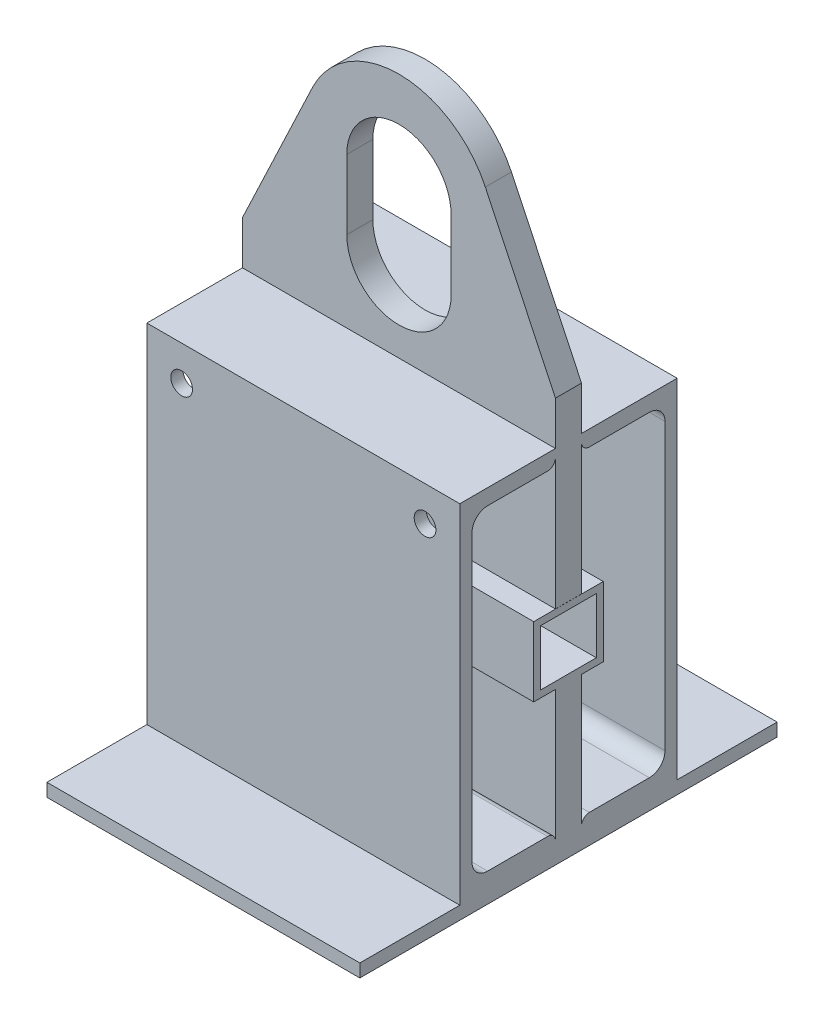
ISO-10303-21;
HEADER;
FILE_DESCRIPTION(('STEP AP214'),'2;1');
FILE_NAME('part.step','',(''),(''),'','','');
FILE_SCHEMA(('AUTOMOTIVE_DESIGN { 1 0 10303 214 1 1 1 1 }'));
ENDSEC;
DATA;
#1=APPLICATION_CONTEXT('core data for automotive mechanical design processes');
#2=APPLICATION_PROTOCOL_DEFINITION('international standard','automotive_design',2000,#1);
#3=PRODUCT_CONTEXT('',#1,'mechanical');
#4=PRODUCT('Part','Part','',(#3));
#5=PRODUCT_RELATED_PRODUCT_CATEGORY('part','',(#4));
#6=PRODUCT_DEFINITION_FORMATION('','',#4);
#7=PRODUCT_DEFINITION_CONTEXT('part definition',#1,'design');
#8=PRODUCT_DEFINITION('design','',#6,#7);
#9=PRODUCT_DEFINITION_SHAPE('','',#8);
#10=(LENGTH_UNIT() NAMED_UNIT(*) SI_UNIT(.MILLI.,.METRE.));
#11=(NAMED_UNIT(*) PLANE_ANGLE_UNIT() SI_UNIT($,.RADIAN.));
#12=(NAMED_UNIT(*) SI_UNIT($,.STERADIAN.) SOLID_ANGLE_UNIT());
#13=UNCERTAINTY_MEASURE_WITH_UNIT(LENGTH_MEASURE(1.E-05),#10,'distance_accuracy_value','');
#14=(GEOMETRIC_REPRESENTATION_CONTEXT(3) GLOBAL_UNCERTAINTY_ASSIGNED_CONTEXT((#13)) GLOBAL_UNIT_ASSIGNED_CONTEXT((#10,
#11,#12)) REPRESENTATION_CONTEXT('',''));
#15=CARTESIAN_POINT('',(0.,0.,0.));
#16=DIRECTION('',(0.,0.,1.));
#17=DIRECTION('',(1.,0.,0.));
#18=AXIS2_PLACEMENT_3D('',#15,#16,#17);
#19=CARTESIAN_POINT('',(-107.543185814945,282.629316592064,-78.));
#20=DIRECTION('',(1.,0.,0.));
#21=DIRECTION('',(0.,0.,-1.));
#22=AXIS2_PLACEMENT_3D('',#19,#20,#21);
#23=CYLINDRICAL_SURFACE('',#22,18.);
#24=DIRECTION('',(1.,0.,0.));
#25=VECTOR('',#24,1.);
#26=CARTESIAN_POINT('',(-107.543185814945,282.629316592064,-96.));
#27=LINE('',#26,#25);
#28=CARTESIAN_POINT('',(-107.543185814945,282.629316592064,-96.));
#29=VERTEX_POINT('',#28);
#30=CARTESIAN_POINT('',(-79.3859050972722,282.629316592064,-96.0000000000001));
#31=VERTEX_POINT('',#30);
#32=EDGE_CURVE('E368',#29,#31,#27,.T.);
#33=ORIENTED_EDGE('',*,*,#32,.T.);
#34=CARTESIAN_POINT('',(-79.3859050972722,282.629316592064,-96.0000000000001));
#35=CARTESIAN_POINT('',(-79.3326333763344,282.787041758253,-96.0000021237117));
#36=CARTESIAN_POINT('',(-79.2762160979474,282.943675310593,-95.9979263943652));
#37=CARTESIAN_POINT('',(-79.1572165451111,283.254462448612,-95.9898122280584));
#38=CARTESIAN_POINT('',(-79.0946348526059,283.408616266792,-95.9837741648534));
#39=CARTESIAN_POINT('',(-78.8979562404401,283.866631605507,-95.9600222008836));
#40=CARTESIAN_POINT('',(-78.7548116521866,284.166384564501,-95.9366696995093));
#41=CARTESIAN_POINT('',(-78.4466632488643,284.750816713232,-95.8769433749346));
#42=CARTESIAN_POINT('',(-78.2817867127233,285.035571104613,-95.8406434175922));
#43=CARTESIAN_POINT('',(-77.9309158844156,285.590116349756,-95.7570352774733));
#44=CARTESIAN_POINT('',(-77.7449175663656,285.859904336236,-95.7097249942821));
#45=CARTESIAN_POINT('',(-77.3538525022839,286.382183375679,-95.6064379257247));
#46=CARTESIAN_POINT('',(-77.1488452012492,286.634724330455,-95.5504878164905));
#47=CARTESIAN_POINT('',(-76.7206571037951,287.12221185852,-95.4320627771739));
#48=CARTESIAN_POINT('',(-76.4974771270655,287.357159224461,-95.3695881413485));
#49=CARTESIAN_POINT('',(-76.033803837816,287.808878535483,-95.2402852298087));
#50=CARTESIAN_POINT('',(-75.7932803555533,288.025617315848,-95.1734493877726));
#51=CARTESIAN_POINT('',(-75.2964802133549,288.439565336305,-95.0378535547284));
#52=CARTESIAN_POINT('',(-75.0402027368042,288.636773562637,-94.9690934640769));
#53=CARTESIAN_POINT('',(-74.4904842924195,289.026822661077,-94.826130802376));
#54=CARTESIAN_POINT('',(-74.1957399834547,289.217844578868,-94.7519662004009));
#55=CARTESIAN_POINT('',(-73.5907054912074,289.574671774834,-94.607200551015));
#56=CARTESIAN_POINT('',(-73.2804221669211,289.740488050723,-94.5365979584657));
#57=CARTESIAN_POINT('',(-72.6458665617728,290.045821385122,-94.4019299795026));
#58=CARTESIAN_POINT('',(-72.3215971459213,290.185343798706,-94.3378632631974));
#59=CARTESIAN_POINT('',(-71.6608882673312,290.436918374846,-94.2191468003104));
#60=CARTESIAN_POINT('',(-71.324449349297,290.548971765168,-94.1644966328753));
#61=CARTESIAN_POINT('',(-70.643775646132,290.743805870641,-94.0675714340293));
#62=CARTESIAN_POINT('',(-70.2996036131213,290.826767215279,-94.0252203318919));
#63=CARTESIAN_POINT('',(-69.6040379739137,290.963354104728,-93.9546155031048));
#64=CARTESIAN_POINT('',(-69.2526444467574,291.016979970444,-93.9263616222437));
#65=CARTESIAN_POINT('',(-68.5459413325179,291.094095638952,-93.8855101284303));
#66=CARTESIAN_POINT('',(-68.19063519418,291.117610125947,-93.872899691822));
#67=CARTESIAN_POINT('',(-67.4791249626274,291.134215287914,-93.8640097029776));
#68=CARTESIAN_POINT('',(-67.1229209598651,291.127308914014,-93.8677285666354));
#69=CARTESIAN_POINT('',(-66.4525151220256,291.085655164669,-93.8899584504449));
#70=CARTESIAN_POINT('',(-66.1380524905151,291.054093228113,-93.9067764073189));
#71=CARTESIAN_POINT('',(-65.5132963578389,290.967427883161,-93.9523759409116));
#72=CARTESIAN_POINT('',(-65.2030025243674,290.912326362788,-93.981156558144));
#73=CARTESIAN_POINT('',(-64.5885091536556,290.779162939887,-94.0494731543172));
#74=CARTESIAN_POINT('',(-64.2843115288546,290.701093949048,-94.0890124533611));
#75=CARTESIAN_POINT('',(-63.683865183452,290.522749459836,-94.1772557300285));
#76=CARTESIAN_POINT('',(-63.3876168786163,290.422472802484,-94.2259601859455));
#77=CARTESIAN_POINT('',(-62.7979494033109,290.198003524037,-94.3318926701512));
#78=CARTESIAN_POINT('',(-62.5047486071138,290.073317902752,-94.389289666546));
#79=CARTESIAN_POINT('',(-61.9295526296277,289.802419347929,-94.5096505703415));
#80=CARTESIAN_POINT('',(-61.6475611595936,289.656199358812,-94.5726162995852));
#81=CARTESIAN_POINT('',(-61.0959228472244,289.343020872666,-94.7019425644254));
#82=CARTESIAN_POINT('',(-60.826283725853,289.176049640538,-94.7683051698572));
#83=CARTESIAN_POINT('',(-60.3006406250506,288.822251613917,-94.9021693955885));
#84=CARTESIAN_POINT('',(-60.0446378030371,288.635423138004,-94.9696711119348));
#85=CARTESIAN_POINT('',(-59.5186160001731,288.219999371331,-95.1113360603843));
#86=CARTESIAN_POINT('',(-59.2503975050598,287.989072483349,-95.1853673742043));
#87=CARTESIAN_POINT('',(-58.7339727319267,287.504734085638,-95.3289952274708));
#88=CARTESIAN_POINT('',(-58.4857596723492,287.251330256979,-95.3985932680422));
#89=CARTESIAN_POINT('',(-58.0112507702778,286.723631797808,-95.53027174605));
#90=CARTESIAN_POINT('',(-57.7849235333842,286.449368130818,-95.5923629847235));
#91=CARTESIAN_POINT('',(-57.3555957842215,285.8811917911,-95.7061901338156));
#92=CARTESIAN_POINT('',(-57.1525877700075,285.587285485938,-95.7579293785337));
#93=CARTESIAN_POINT('',(-56.832194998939,285.077905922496,-95.8339030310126));
#94=CARTESIAN_POINT('',(-56.7080868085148,284.867151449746,-95.8616548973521));
#95=CARTESIAN_POINT('',(-56.4721671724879,284.438141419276,-95.9101852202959));
#96=CARTESIAN_POINT('',(-56.3603523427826,284.219887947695,-95.930965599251));
#97=CARTESIAN_POINT('',(-56.1493511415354,283.776252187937,-95.9648009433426));
#98=CARTESIAN_POINT('',(-56.0501894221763,283.550857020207,-95.9778410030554));
#99=CARTESIAN_POINT('',(-55.8651895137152,283.094207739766,-95.9954519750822));
#100=CARTESIAN_POINT('',(-55.7793583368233,282.862950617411,-96.0000184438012));
#101=CARTESIAN_POINT('',(-55.7004665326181,282.629316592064,-96.0000000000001));
#102=B_SPLINE_CURVE_WITH_KNOTS('',3,(#34,#35,#36,#37,#38,#39,#40,#41,#42,#43,#44,#45,#46,#47,
#48,#49,#50,#51,#52,#53,#54,#55,#56,#57,#58,#59,#60,#61,#62,#63,#64,#65,#66,#67,#68,#69,#70,#71,
#72,#73,#74,#75,#76,#77,#78,#79,#80,#81,#82,#83,#84,#85,#86,#87,#88,#89,#90,#91,#92,#93,#94,#95,
#96,#97,#98,#99,#100,#101),.UNSPECIFIED.,.F.,.F.,(4,2,2,2,2,2,2,2,2,2,2,2,2,2,2,2,2,2,2,2,2,2,2,
2,2,2,2,2,2,2,2,2,2,4),(0.,0.499337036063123,0.99862697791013,1.9961419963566,2.98805485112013,
3.98015708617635,4.96925521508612,5.95830875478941,6.94912635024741,7.93999534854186,
9.01568515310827,10.0909042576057,11.1659041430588,12.2408559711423,13.3090101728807,
14.377152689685,15.4444190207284,16.5115818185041,17.4599264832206,18.4081950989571,
19.356756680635,20.305367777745,21.2755995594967,22.2461499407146,23.2172989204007,
24.1885301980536,25.2720292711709,26.3551594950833,27.4367122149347,28.5179160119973,
29.2559007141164,29.9936817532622,30.7328789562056,31.4724636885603),.UNSPECIFIED.);
#103=CARTESIAN_POINT('',(-55.7004665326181,282.629316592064,-96.));
#104=VERTEX_POINT('',#103);
#105=EDGE_CURVE('E11',#31,#104,#102,.T.);
#106=ORIENTED_EDGE('',*,*,#105,.T.);
#107=CARTESIAN_POINT('',(200.614094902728,282.629316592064,-96.0000000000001));
#108=VERTEX_POINT('',#107);
#109=EDGE_CURVE('E362',#104,#108,#27,.T.);
#110=ORIENTED_EDGE('',*,*,#109,.T.);
#111=CARTESIAN_POINT('',(200.614094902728,282.629316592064,-96.0000000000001));
#112=CARTESIAN_POINT('',(200.667366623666,282.787041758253,-96.0000021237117));
#113=CARTESIAN_POINT('',(200.723783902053,282.943675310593,-95.9979263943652));
#114=CARTESIAN_POINT('',(200.842783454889,283.254462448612,-95.9898122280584));
#115=CARTESIAN_POINT('',(200.905365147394,283.408616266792,-95.9837741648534));
#116=CARTESIAN_POINT('',(201.10204375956,283.866631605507,-95.9600222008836));
#117=CARTESIAN_POINT('',(201.245188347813,284.1663845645,-95.9366696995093));
#118=CARTESIAN_POINT('',(201.553336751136,284.750816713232,-95.8769433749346));
#119=CARTESIAN_POINT('',(201.718213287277,285.035571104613,-95.8406434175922));
#120=CARTESIAN_POINT('',(202.069084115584,285.590116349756,-95.7570352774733));
#121=CARTESIAN_POINT('',(202.255082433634,285.859904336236,-95.7097249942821));
#122=CARTESIAN_POINT('',(202.646147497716,286.382183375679,-95.6064379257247));
#123=CARTESIAN_POINT('',(202.851154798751,286.634724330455,-95.5504878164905));
#124=CARTESIAN_POINT('',(203.279342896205,287.12221185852,-95.4320627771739));
#125=CARTESIAN_POINT('',(203.502522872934,287.357159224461,-95.3695881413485));
#126=CARTESIAN_POINT('',(203.966196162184,287.808878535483,-95.2402852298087));
#127=CARTESIAN_POINT('',(204.206719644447,288.025617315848,-95.1734493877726));
#128=CARTESIAN_POINT('',(204.703519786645,288.439565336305,-95.0378535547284));
#129=CARTESIAN_POINT('',(204.959797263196,288.636773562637,-94.9690934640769));
#130=CARTESIAN_POINT('',(205.509515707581,289.026822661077,-94.826130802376));
#131=CARTESIAN_POINT('',(205.804260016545,289.217844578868,-94.7519662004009));
#132=CARTESIAN_POINT('',(206.409294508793,289.574671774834,-94.607200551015));
#133=CARTESIAN_POINT('',(206.719577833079,289.740488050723,-94.5365979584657));
#134=CARTESIAN_POINT('',(207.354133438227,290.045821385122,-94.4019299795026));
#135=CARTESIAN_POINT('',(207.678402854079,290.185343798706,-94.3378632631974));
#136=CARTESIAN_POINT('',(208.339111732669,290.436918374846,-94.2191468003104));
#137=CARTESIAN_POINT('',(208.675550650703,290.548971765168,-94.1644966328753));
#138=CARTESIAN_POINT('',(209.356224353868,290.743805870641,-94.0675714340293));
#139=CARTESIAN_POINT('',(209.700396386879,290.826767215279,-94.0252203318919));
#140=CARTESIAN_POINT('',(210.395962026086,290.963354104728,-93.9546155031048));
#141=CARTESIAN_POINT('',(210.747355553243,291.016979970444,-93.9263616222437));
#142=CARTESIAN_POINT('',(211.454058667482,291.094095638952,-93.8855101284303));
#143=CARTESIAN_POINT('',(211.80936480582,291.117610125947,-93.872899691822));
#144=CARTESIAN_POINT('',(212.520875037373,291.134215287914,-93.8640097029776));
#145=CARTESIAN_POINT('',(212.877079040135,291.127308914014,-93.8677285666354));
#146=CARTESIAN_POINT('',(213.547484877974,291.085655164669,-93.8899584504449));
#147=CARTESIAN_POINT('',(213.861947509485,291.054093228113,-93.9067764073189));
#148=CARTESIAN_POINT('',(214.486703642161,290.967427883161,-93.9523759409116));
#149=CARTESIAN_POINT('',(214.796997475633,290.912326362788,-93.9811565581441));
#150=CARTESIAN_POINT('',(215.411490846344,290.779162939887,-94.0494731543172));
#151=CARTESIAN_POINT('',(215.715688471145,290.701093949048,-94.0890124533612));
#152=CARTESIAN_POINT('',(216.316134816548,290.522749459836,-94.1772557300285));
#153=CARTESIAN_POINT('',(216.612383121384,290.422472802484,-94.2259601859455));
#154=CARTESIAN_POINT('',(217.202050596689,290.198003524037,-94.3318926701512));
#155=CARTESIAN_POINT('',(217.495251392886,290.073317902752,-94.389289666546));
#156=CARTESIAN_POINT('',(218.070447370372,289.802419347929,-94.5096505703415));
#157=CARTESIAN_POINT('',(218.352438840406,289.656199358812,-94.5726162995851));
#158=CARTESIAN_POINT('',(218.904077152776,289.343020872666,-94.7019425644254));
#159=CARTESIAN_POINT('',(219.173716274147,289.176049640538,-94.7683051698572));
#160=CARTESIAN_POINT('',(219.699359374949,288.822251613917,-94.9021693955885));
#161=CARTESIAN_POINT('',(219.955362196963,288.635423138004,-94.9696711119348));
#162=CARTESIAN_POINT('',(220.481383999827,288.219999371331,-95.1113360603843));
#163=CARTESIAN_POINT('',(220.74960249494,287.989072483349,-95.1853673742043));
#164=CARTESIAN_POINT('',(221.266027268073,287.504734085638,-95.3289952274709));
#165=CARTESIAN_POINT('',(221.514240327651,287.251330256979,-95.3985932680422));
#166=CARTESIAN_POINT('',(221.988749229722,286.723631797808,-95.53027174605));
#167=CARTESIAN_POINT('',(222.215076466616,286.449368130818,-95.5923629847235));
#168=CARTESIAN_POINT('',(222.644404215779,285.8811917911,-95.7061901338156));
#169=CARTESIAN_POINT('',(222.847412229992,285.587285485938,-95.7579293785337));
#170=CARTESIAN_POINT('',(223.167805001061,285.077905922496,-95.8339030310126));
#171=CARTESIAN_POINT('',(223.291913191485,284.867151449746,-95.8616548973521));
#172=CARTESIAN_POINT('',(223.527832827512,284.438141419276,-95.9101852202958));
#173=CARTESIAN_POINT('',(223.639647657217,284.219887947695,-95.930965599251));
#174=CARTESIAN_POINT('',(223.850648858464,283.776252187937,-95.9648009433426));
#175=CARTESIAN_POINT('',(223.949810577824,283.550857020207,-95.9778410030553));
#176=CARTESIAN_POINT('',(224.134810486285,283.094207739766,-95.9954519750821));
#177=CARTESIAN_POINT('',(224.220641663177,282.862950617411,-96.0000184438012));
#178=CARTESIAN_POINT('',(224.299533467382,282.629316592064,-96.0000000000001));
#179=B_SPLINE_CURVE_WITH_KNOTS('',3,(#111,#112,#113,#114,#115,#116,#117,#118,#119,#120,#121,
#122,#123,#124,#125,#126,#127,#128,#129,#130,#131,#132,#133,#134,#135,#136,#137,#138,#139,#140,
#141,#142,#143,#144,#145,#146,#147,#148,#149,#150,#151,#152,#153,#154,#155,#156,#157,#158,#159,
#160,#161,#162,#163,#164,#165,#166,#167,#168,#169,#170,#171,#172,#173,#174,#175,#176,#177,#178),
.UNSPECIFIED.,.F.,.F.,(4,2,2,2,2,2,2,2,2,2,2,2,2,2,2,2,2,2,2,2,2,2,2,2,2,2,2,2,2,2,2,2,2,4),(0.,
0.499337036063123,0.998626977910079,1.9961419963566,2.98805485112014,3.98015708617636,
4.96925521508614,5.95830875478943,6.94912635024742,7.93999534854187,9.01568515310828,
10.0909042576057,11.1659041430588,12.2408559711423,13.3090101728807,14.377152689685,
15.4444190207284,16.5115818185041,17.4599264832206,18.4081950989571,19.356756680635,
20.305367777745,21.2755995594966,22.2461499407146,23.2172989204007,24.1885301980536,
25.2720292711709,26.3551594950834,27.4367122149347,28.5179160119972,29.2559007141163,
29.9936817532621,30.7328789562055,31.4724636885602),.UNSPECIFIED.);
#180=CARTESIAN_POINT('',(224.299533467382,282.629316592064,-96.));
#181=VERTEX_POINT('',#180);
#182=EDGE_CURVE('E48',#108,#181,#179,.T.);
#183=ORIENTED_EDGE('',*,*,#182,.T.);
#184=CARTESIAN_POINT('',(252.456814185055,282.629316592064,-96.));
#185=VERTEX_POINT('',#184);
#186=EDGE_CURVE('E364',#181,#185,#27,.T.);
#187=ORIENTED_EDGE('',*,*,#186,.T.);
#188=CARTESIAN_POINT('',(252.456814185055,282.629316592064,-78.));
#189=DIRECTION('',(-1.,0.,0.));
#190=DIRECTION('',(0.,0.,-1.));
#191=AXIS2_PLACEMENT_3D('',#188,#189,#190);
#192=CIRCLE('',#191,18.);
#193=CARTESIAN_POINT('',(252.456814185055,300.629316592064,-78.));
#194=VERTEX_POINT('',#193);
#195=EDGE_CURVE('E754',#194,#185,#192,.T.);
#196=ORIENTED_EDGE('',*,*,#195,.F.);
#197=DIRECTION('',(1.,0.,0.));
#198=VECTOR('',#197,1.);
#199=CARTESIAN_POINT('',(-107.543185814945,300.629316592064,-78.));
#200=LINE('',#199,#198);
#201=CARTESIAN_POINT('',(-107.543185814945,300.629316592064,-78.));
#202=VERTEX_POINT('',#201);
#203=EDGE_CURVE('E371',#202,#194,#200,.T.);
#204=ORIENTED_EDGE('',*,*,#203,.F.);
#205=CARTESIAN_POINT('',(-107.543185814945,282.629316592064,-78.));
#206=DIRECTION('',(-1.,0.,0.));
#207=DIRECTION('',(0.,0.,-1.));
#208=AXIS2_PLACEMENT_3D('',#205,#206,#207);
#209=CIRCLE('',#208,18.);
#210=EDGE_CURVE('E780',#202,#29,#209,.T.);
#211=ORIENTED_EDGE('',*,*,#210,.T.);
#212=EDGE_LOOP('',(#33,#106,#110,#183,#187,#196,#204,#211));
#213=FACE_BOUND('',#212,.T.);
#214=ADVANCED_FACE('F35',(#213),#23,.F.);
#215=CARTESIAN_POINT('',(0.,0.,30.));
#216=DIRECTION('',(0.,0.,1.));
#217=DIRECTION('',(1.,0.,0.));
#218=AXIS2_PLACEMENT_3D('',#215,#216,#217);
#219=PLANE('',#218);
#220=DIRECTION('',(0.,1.,0.));
#221=VECTOR('',#220,1.);
#222=CARTESIAN_POINT('',(252.456814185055,0.,30.));
#223=LINE('',#222,#221);
#224=CARTESIAN_POINT('',(252.456814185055,158.77256621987,30.));
#225=VERTEX_POINT('',#224);
#226=CARTESIAN_POINT('',(252.456814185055,309.629316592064,30.));
#227=VERTEX_POINT('',#226);
#228=EDGE_CURVE('E408',#225,#227,#223,.T.);
#229=ORIENTED_EDGE('',*,*,#228,.T.);
#230=DIRECTION('',(1.,0.,0.));
#231=VECTOR('',#230,1.);
#232=CARTESIAN_POINT('',(-107.543185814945,309.629316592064,30.));
#233=LINE('',#232,#231);
#234=CARTESIAN_POINT('',(-107.543185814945,309.629316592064,30.));
#235=VERTEX_POINT('',#234);
#236=EDGE_CURVE('E962',#235,#227,#233,.T.);
#237=ORIENTED_EDGE('',*,*,#236,.F.);
#238=DIRECTION('',(0.,1.,0.));
#239=VECTOR('',#238,1.);
#240=CARTESIAN_POINT('',(-107.543185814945,0.,30.));
#241=LINE('',#240,#239);
#242=CARTESIAN_POINT('',(-107.543185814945,158.77256621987,30.));
#243=VERTEX_POINT('',#242);
#244=EDGE_CURVE('E402',#243,#235,#241,.T.);
#245=ORIENTED_EDGE('',*,*,#244,.F.);
#246=DIRECTION('',(1.,0.,0.));
#247=VECTOR('',#246,1.);
#248=CARTESIAN_POINT('',(0.,158.77256621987,30.));
#249=LINE('',#248,#247);
#250=EDGE_CURVE('E405',#243,#225,#249,.T.);
#251=ORIENTED_EDGE('',*,*,#250,.T.);
#252=EDGE_LOOP('',(#229,#237,#245,#251));
#253=FACE_BOUND('',#252,.T.);
#254=ADVANCED_FACE('F535',(#253),#219,.T.);
#255=CARTESIAN_POINT('',(72.4568141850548,411.624733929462,30.));
#256=DIRECTION('',(0.,0.,1.));
#257=DIRECTION('',(1.,0.,0.));
#258=AXIS2_PLACEMENT_3D('',#255,#256,#257);
#259=CIRCLE('',#258,60.);
#260=CARTESIAN_POINT('',(12.4568141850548,411.624733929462,30.));
#261=VERTEX_POINT('',#260);
#262=CARTESIAN_POINT('',(132.456814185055,411.624733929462,30.));
#263=VERTEX_POINT('',#262);
#264=EDGE_CURVE('E382',#261,#263,#259,.T.);
#265=ORIENTED_EDGE('',*,*,#264,.F.);
#266=DIRECTION('',(0.,1.,0.));
#267=VECTOR('',#266,1.);
#268=CARTESIAN_POINT('',(12.4568141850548,0.,30.));
#269=LINE('',#268,#267);
#270=CARTESIAN_POINT('',(12.4568141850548,491.624733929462,30.));
#271=VERTEX_POINT('',#270);
#272=EDGE_CURVE('E385',#261,#271,#269,.T.);
#273=ORIENTED_EDGE('',*,*,#272,.T.);
#274=CARTESIAN_POINT('',(72.4568141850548,491.624733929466,30.));
#275=DIRECTION('',(0.,0.,1.));
#276=DIRECTION('',(1.,0.,0.));
#277=AXIS2_PLACEMENT_3D('',#274,#275,#276);
#278=CIRCLE('',#277,60.);
#279=CARTESIAN_POINT('',(132.456814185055,491.624733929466,30.));
#280=VERTEX_POINT('',#279);
#281=EDGE_CURVE('E388',#280,#271,#278,.T.);
#282=ORIENTED_EDGE('',*,*,#281,.F.);
#283=DIRECTION('',(0.,-1.,0.));
#284=VECTOR('',#283,1.);
#285=CARTESIAN_POINT('',(132.456814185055,0.,30.));
#286=LINE('',#285,#284);
#287=EDGE_CURVE('E391',#280,#263,#286,.T.);
#288=ORIENTED_EDGE('',*,*,#287,.T.);
#289=EDGE_LOOP('',(#265,#273,#282,#288));
#290=FACE_BOUND('',#289,.T.);
#291=CARTESIAN_POINT('',(-107.543185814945,318.629316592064,30.));
#292=VERTEX_POINT('',#291);
#293=CARTESIAN_POINT('',(-107.543185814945,368.77256621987,30.));
#294=VERTEX_POINT('',#293);
#295=EDGE_CURVE('E401',#292,#294,#241,.T.);
#296=ORIENTED_EDGE('',*,*,#295,.F.);
#297=DIRECTION('',(1.,0.,0.));
#298=VECTOR('',#297,1.);
#299=CARTESIAN_POINT('',(-107.543185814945,318.629316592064,30.));
#300=LINE('',#299,#298);
#301=CARTESIAN_POINT('',(252.456814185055,318.629316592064,30.));
#302=VERTEX_POINT('',#301);
#303=EDGE_CURVE('E611',#292,#302,#300,.T.);
#304=ORIENTED_EDGE('',*,*,#303,.T.);
#305=CARTESIAN_POINT('',(252.456814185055,368.77256621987,30.));
#306=VERTEX_POINT('',#305);
#307=EDGE_CURVE('E407',#302,#306,#223,.T.);
#308=ORIENTED_EDGE('',*,*,#307,.T.);
#309=DIRECTION('',(-0.428477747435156,0.903552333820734,0.));
#310=VECTOR('',#309,1.);
#311=CARTESIAN_POINT('',(348.878526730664,165.443306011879,30.));
#312=LINE('',#311,#310);
#313=CARTESIAN_POINT('',(171.847570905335,538.757286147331,30.));
#314=VERTEX_POINT('',#313);
#315=EDGE_CURVE('E393',#306,#314,#312,.T.);
#316=ORIENTED_EDGE('',*,*,#315,.T.);
#317=CARTESIAN_POINT('',(72.4568141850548,491.624733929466,30.));
#318=DIRECTION('',(0.,0.,1.));
#319=DIRECTION('',(1.,0.,0.));
#320=AXIS2_PLACEMENT_3D('',#317,#318,#319);
#321=CIRCLE('',#320,109.999999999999);
#322=CARTESIAN_POINT('',(-26.9339425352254,538.757286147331,30.));
#323=VERTEX_POINT('',#322);
#324=EDGE_CURVE('E396',#314,#323,#321,.T.);
#325=ORIENTED_EDGE('',*,*,#324,.T.);
#326=DIRECTION('',(0.428477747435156,0.903552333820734,0.));
#327=VECTOR('',#326,1.);
#328=CARTESIAN_POINT('',(-230.570052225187,109.3396950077,30.));
#329=LINE('',#328,#327);
#330=EDGE_CURVE('E398',#294,#323,#329,.T.);
#331=ORIENTED_EDGE('',*,*,#330,.F.);
#332=EDGE_LOOP('',(#296,#304,#308,#316,#325,#331));
#333=FACE_BOUND('',#332,.T.);
#334=ADVANCED_FACE('F539',(#290,#333),#219,.T.);
#335=CARTESIAN_POINT('',(-107.543185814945,-81.3706834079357,30.));
#336=DIRECTION('',(0.,0.,-1.));
#337=DIRECTION('',(-1.,0.,0.));
#338=AXIS2_PLACEMENT_3D('',#335,#336,#337);
#339=PLANE('',#338);
#340=DIRECTION('',(1.,0.,0.));
#341=VECTOR('',#340,1.);
#342=CARTESIAN_POINT('',(-107.543185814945,-72.3706834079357,30.));
#343=LINE('',#342,#341);
#344=CARTESIAN_POINT('',(-107.543185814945,-72.3706834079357,30.));
#345=VERTEX_POINT('',#344);
#346=CARTESIAN_POINT('',(252.456814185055,-72.3706834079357,30.));
#347=VERTEX_POINT('',#346);
#348=EDGE_CURVE('E975',#345,#347,#343,.T.);
#349=ORIENTED_EDGE('',*,*,#348,.T.);
#350=DIRECTION('',(0.,1.,0.));
#351=VECTOR('',#350,1.);
#352=CARTESIAN_POINT('',(252.456814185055,-81.3706834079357,30.0000000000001));
#353=LINE('',#352,#351);
#354=CARTESIAN_POINT('',(252.456814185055,78.6293165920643,30.));
#355=VERTEX_POINT('',#354);
#356=EDGE_CURVE('E675',#347,#355,#353,.T.);
#357=ORIENTED_EDGE('',*,*,#356,.T.);
#358=DIRECTION('',(-1.,0.,0.));
#359=VECTOR('',#358,1.);
#360=CARTESIAN_POINT('',(-107.543185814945,78.6293165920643,30.));
#361=LINE('',#360,#359);
#362=CARTESIAN_POINT('',(-107.543185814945,78.6293165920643,30.));
#363=VERTEX_POINT('',#362);
#364=EDGE_CURVE('E670',#355,#363,#361,.T.);
#365=ORIENTED_EDGE('',*,*,#364,.T.);
#366=DIRECTION('',(0.,1.,0.));
#367=VECTOR('',#366,1.);
#368=CARTESIAN_POINT('',(-107.543185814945,-81.3706834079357,30.));
#369=LINE('',#368,#367);
#370=EDGE_CURVE('E673',#345,#363,#369,.T.);
#371=ORIENTED_EDGE('',*,*,#370,.F.);
#372=EDGE_LOOP('',(#349,#357,#365,#371));
#373=FACE_BOUND('',#372,.T.);
#374=ADVANCED_FACE('F545',(#373),#339,.F.);
#375=CARTESIAN_POINT('',(0.,-81.3706834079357,0.));
#376=DIRECTION('',(0.,-1.,0.));
#377=DIRECTION('',(0.,0.,-1.));
#378=AXIS2_PLACEMENT_3D('',#375,#376,#377);
#379=PLANE('',#378);
#380=DIRECTION('',(1.,0.,0.));
#381=VECTOR('',#380,1.);
#382=CARTESIAN_POINT('',(-107.543185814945,-81.3706834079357,140.));
#383=LINE('',#382,#381);
#384=CARTESIAN_POINT('',(-107.543185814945,-81.3706834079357,140.));
#385=VERTEX_POINT('',#384);
#386=CARTESIAN_POINT('',(252.456814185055,-81.3706834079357,140.));
#387=VERTEX_POINT('',#386);
#388=EDGE_CURVE('E629',#385,#387,#383,.T.);
#389=ORIENTED_EDGE('',*,*,#388,.F.);
#390=DIRECTION('',(0.,0.,-1.));
#391=VECTOR('',#390,1.);
#392=CARTESIAN_POINT('',(-107.543185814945,-81.3706834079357,255.));
#393=LINE('',#392,#391);
#394=CARTESIAN_POINT('',(-107.543185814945,-81.3706834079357,255.));
#395=VERTEX_POINT('',#394);
#396=EDGE_CURVE('E646',#395,#385,#393,.T.);
#397=ORIENTED_EDGE('',*,*,#396,.F.);
#398=DIRECTION('',(-1.,0.,0.));
#399=VECTOR('',#398,1.);
#400=CARTESIAN_POINT('',(-107.543185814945,-81.3706834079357,255.));
#401=LINE('',#400,#399);
#402=CARTESIAN_POINT('',(252.456814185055,-81.3706834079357,255.));
#403=VERTEX_POINT('',#402);
#404=EDGE_CURVE('E639',#403,#395,#401,.T.);
#405=ORIENTED_EDGE('',*,*,#404,.F.);
#406=DIRECTION('',(0.,0.,1.));
#407=VECTOR('',#406,1.);
#408=CARTESIAN_POINT('',(252.456814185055,-81.3706834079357,255.));
#409=LINE('',#408,#407);
#410=EDGE_CURVE('E651',#387,#403,#409,.T.);
#411=ORIENTED_EDGE('',*,*,#410,.F.);
#412=EDGE_LOOP('',(#389,#397,#405,#411));
#413=FACE_BOUND('',#412,.T.);
#414=ADVANCED_FACE('F879',(#413),#379,.F.);
#415=CARTESIAN_POINT('',(0.,0.,0.));
#416=DIRECTION('',(0.,0.,1.));
#417=DIRECTION('',(1.,0.,0.));
#418=AXIS2_PLACEMENT_3D('',#415,#416,#417);
#419=PLANE('',#418);
#420=CARTESIAN_POINT('',(72.4568141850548,411.624733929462,0.));
#421=DIRECTION('',(0.,0.,1.));
#422=DIRECTION('',(1.,0.,0.));
#423=AXIS2_PLACEMENT_3D('',#420,#421,#422);
#424=CIRCLE('',#423,60.);
#425=CARTESIAN_POINT('',(12.4568141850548,411.624733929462,0.));
#426=VERTEX_POINT('',#425);
#427=CARTESIAN_POINT('',(132.456814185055,411.624733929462,0.));
#428=VERTEX_POINT('',#427);
#429=EDGE_CURVE('E411',#426,#428,#424,.T.);
#430=ORIENTED_EDGE('',*,*,#429,.T.);
#431=DIRECTION('',(0.,-1.,0.));
#432=VECTOR('',#431,1.);
#433=CARTESIAN_POINT('',(132.456814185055,0.,0.));
#434=LINE('',#433,#432);
#435=CARTESIAN_POINT('',(132.456814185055,491.624733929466,0.));
#436=VERTEX_POINT('',#435);
#437=EDGE_CURVE('E421',#436,#428,#434,.T.);
#438=ORIENTED_EDGE('',*,*,#437,.F.);
#439=CARTESIAN_POINT('',(72.4568141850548,491.624733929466,0.));
#440=DIRECTION('',(0.,0.,1.));
#441=DIRECTION('',(1.,0.,0.));
#442=AXIS2_PLACEMENT_3D('',#439,#440,#441);
#443=CIRCLE('',#442,60.);
#444=CARTESIAN_POINT('',(12.4568141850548,491.624733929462,0.));
#445=VERTEX_POINT('',#444);
#446=EDGE_CURVE('E418',#436,#445,#443,.T.);
#447=ORIENTED_EDGE('',*,*,#446,.T.);
#448=DIRECTION('',(0.,1.,0.));
#449=VECTOR('',#448,1.);
#450=CARTESIAN_POINT('',(12.4568141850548,0.,0.));
#451=LINE('',#450,#449);
#452=EDGE_CURVE('E414',#426,#445,#451,.T.);
#453=ORIENTED_EDGE('',*,*,#452,.F.);
#454=EDGE_LOOP('',(#430,#438,#447,#453));
#455=FACE_BOUND('',#454,.T.);
#456=DIRECTION('',(0.,1.,0.));
#457=VECTOR('',#456,1.);
#458=CARTESIAN_POINT('',(252.456814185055,0.,0.));
#459=LINE('',#458,#457);
#460=CARTESIAN_POINT('',(252.456814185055,318.629316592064,0.));
#461=VERTEX_POINT('',#460);
#462=CARTESIAN_POINT('',(252.456814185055,368.77256621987,0.));
#463=VERTEX_POINT('',#462);
#464=EDGE_CURVE('E439',#461,#463,#459,.T.);
#465=ORIENTED_EDGE('',*,*,#464,.F.);
#466=DIRECTION('',(1.,0.,0.));
#467=VECTOR('',#466,1.);
#468=CARTESIAN_POINT('',(-107.543185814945,318.629316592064,0.));
#469=LINE('',#468,#467);
#470=CARTESIAN_POINT('',(-107.543185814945,318.629316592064,0.));
#471=VERTEX_POINT('',#470);
#472=EDGE_CURVE('E415',#471,#461,#469,.T.);
#473=ORIENTED_EDGE('',*,*,#472,.F.);
#474=DIRECTION('',(0.,1.,0.));
#475=VECTOR('',#474,1.);
#476=CARTESIAN_POINT('',(-107.543185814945,0.,0.));
#477=LINE('',#476,#475);
#478=CARTESIAN_POINT('',(-107.543185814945,368.77256621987,0.));
#479=VERTEX_POINT('',#478);
#480=EDGE_CURVE('E433',#471,#479,#477,.T.);
#481=ORIENTED_EDGE('',*,*,#480,.T.);
#482=DIRECTION('',(0.428477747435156,0.903552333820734,0.));
#483=VECTOR('',#482,1.);
#484=CARTESIAN_POINT('',(-230.570052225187,109.3396950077,0.));
#485=LINE('',#484,#483);
#486=CARTESIAN_POINT('',(-26.9339425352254,538.757286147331,0.));
#487=VERTEX_POINT('',#486);
#488=EDGE_CURVE('E430',#479,#487,#485,.T.);
#489=ORIENTED_EDGE('',*,*,#488,.T.);
#490=CARTESIAN_POINT('',(72.4568141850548,491.624733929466,0.));
#491=DIRECTION('',(0.,0.,1.));
#492=DIRECTION('',(1.,0.,0.));
#493=AXIS2_PLACEMENT_3D('',#490,#491,#492);
#494=CIRCLE('',#493,109.999999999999);
#495=CARTESIAN_POINT('',(171.847570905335,538.757286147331,0.));
#496=VERTEX_POINT('',#495);
#497=EDGE_CURVE('E427',#496,#487,#494,.T.);
#498=ORIENTED_EDGE('',*,*,#497,.F.);
#499=DIRECTION('',(-0.428477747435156,0.903552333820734,0.));
#500=VECTOR('',#499,1.);
#501=CARTESIAN_POINT('',(348.878526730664,165.443306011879,0.));
#502=LINE('',#501,#500);
#503=EDGE_CURVE('E424',#463,#496,#502,.T.);
#504=ORIENTED_EDGE('',*,*,#503,.F.);
#505=EDGE_LOOP('',(#465,#473,#481,#489,#498,#504));
#506=FACE_BOUND('',#505,.T.);
#507=ADVANCED_FACE('F556',(#455,#506),#419,.F.);
#508=CARTESIAN_POINT('',(348.878526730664,165.443306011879,30.));
#509=DIRECTION('',(-0.903552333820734,-0.428477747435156,0.));
#510=DIRECTION('',(0.428477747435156,-0.903552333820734,0.));
#511=AXIS2_PLACEMENT_3D('',#508,#509,#510);
#512=PLANE('',#511);
#513=ORIENTED_EDGE('',*,*,#503,.T.);
#514=DIRECTION('',(0.,0.,-1.));
#515=VECTOR('',#514,1.);
#516=CARTESIAN_POINT('',(171.847570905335,538.757286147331,30.));
#517=LINE('',#516,#515);
#518=EDGE_CURVE('E358',#314,#496,#517,.T.);
#519=ORIENTED_EDGE('',*,*,#518,.F.);
#520=ORIENTED_EDGE('',*,*,#315,.F.);
#521=DIRECTION('',(0.,0.,-1.));
#522=VECTOR('',#521,1.);
#523=CARTESIAN_POINT('',(252.456814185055,368.77256621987,30.));
#524=LINE('',#523,#522);
#525=EDGE_CURVE('E442',#306,#463,#524,.T.);
#526=ORIENTED_EDGE('',*,*,#525,.T.);
#527=EDGE_LOOP('',(#513,#519,#520,#526));
#528=FACE_BOUND('',#527,.T.);
#529=ADVANCED_FACE('F576',(#528),#512,.F.);
#530=CARTESIAN_POINT('',(72.4568141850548,491.624733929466,30.));
#531=DIRECTION('',(0.,0.,-1.));
#532=DIRECTION('',(-1.,0.,0.));
#533=AXIS2_PLACEMENT_3D('',#530,#531,#532);
#534=CYLINDRICAL_SURFACE('',#533,109.999999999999);
#535=ORIENTED_EDGE('',*,*,#497,.T.);
#536=DIRECTION('',(0.,0.,-1.));
#537=VECTOR('',#536,1.);
#538=CARTESIAN_POINT('',(-26.9339425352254,538.757286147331,30.));
#539=LINE('',#538,#537);
#540=EDGE_CURVE('E454',#323,#487,#539,.T.);
#541=ORIENTED_EDGE('',*,*,#540,.F.);
#542=ORIENTED_EDGE('',*,*,#324,.F.);
#543=ORIENTED_EDGE('',*,*,#518,.T.);
#544=EDGE_LOOP('',(#535,#541,#542,#543));
#545=FACE_BOUND('',#544,.T.);
#546=ADVANCED_FACE('F572',(#545),#534,.T.);
#547=CARTESIAN_POINT('',(-230.570052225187,109.3396950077,30.));
#548=DIRECTION('',(-0.903552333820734,0.428477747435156,0.));
#549=DIRECTION('',(-0.428477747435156,-0.903552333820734,0.));
#550=AXIS2_PLACEMENT_3D('',#547,#548,#549);
#551=PLANE('',#550);
#552=ORIENTED_EDGE('',*,*,#488,.F.);
#553=DIRECTION('',(0.,0.,-1.));
#554=VECTOR('',#553,1.);
#555=CARTESIAN_POINT('',(-107.543185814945,368.77256621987,30.));
#556=LINE('',#555,#554);
#557=EDGE_CURVE('E451',#294,#479,#556,.T.);
#558=ORIENTED_EDGE('',*,*,#557,.F.);
#559=ORIENTED_EDGE('',*,*,#330,.T.);
#560=ORIENTED_EDGE('',*,*,#540,.T.);
#561=EDGE_LOOP('',(#552,#558,#559,#560));
#562=FACE_BOUND('',#561,.T.);
#563=ADVANCED_FACE('F568',(#562),#551,.T.);
#564=CARTESIAN_POINT('',(-107.543185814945,0.,30.));
#565=DIRECTION('',(-1.,0.,0.));
#566=DIRECTION('',(0.,0.,1.));
#567=AXIS2_PLACEMENT_3D('',#564,#565,#566);
#568=PLANE('',#567);
#569=ORIENTED_EDGE('',*,*,#244,.T.);
#570=CARTESIAN_POINT('',(-107.543185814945,309.629316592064,39.));
#571=DIRECTION('',(-1.,0.,0.));
#572=DIRECTION('',(0.,0.,1.));
#573=AXIS2_PLACEMENT_3D('',#570,#571,#572);
#574=CIRCLE('',#573,8.99999999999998);
#575=CARTESIAN_POINT('',(-107.543185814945,300.629316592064,39.));
#576=VERTEX_POINT('',#575);
#577=EDGE_CURVE('E627',#235,#576,#574,.T.);
#578=ORIENTED_EDGE('',*,*,#577,.T.);
#579=DIRECTION('',(0.,0.,1.));
#580=VECTOR('',#579,1.);
#581=CARTESIAN_POINT('',(-107.543185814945,300.629316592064,108.));
#582=LINE('',#581,#580);
#583=CARTESIAN_POINT('',(-107.543185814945,300.629316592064,108.));
#584=VERTEX_POINT('',#583);
#585=EDGE_CURVE('E631',#576,#584,#582,.T.);
#586=ORIENTED_EDGE('',*,*,#585,.T.);
#587=CARTESIAN_POINT('',(-107.543185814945,282.629316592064,108.));
#588=DIRECTION('',(1.,0.,0.));
#589=DIRECTION('',(0.,0.,1.));
#590=AXIS2_PLACEMENT_3D('',#587,#588,#589);
#591=CIRCLE('',#590,18.);
#592=CARTESIAN_POINT('',(-107.543185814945,282.629316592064,126.));
#593=VERTEX_POINT('',#592);
#594=EDGE_CURVE('E959',#584,#593,#591,.T.);
#595=ORIENTED_EDGE('',*,*,#594,.T.);
#596=DIRECTION('',(0.,-1.,0.));
#597=VECTOR('',#596,1.);
#598=CARTESIAN_POINT('',(-107.543185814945,-45.3706834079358,126.));
#599=LINE('',#598,#597);
#600=CARTESIAN_POINT('',(-107.543185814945,-45.3706834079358,126.));
#601=VERTEX_POINT('',#600);
#602=EDGE_CURVE('E957',#593,#601,#599,.T.);
#603=ORIENTED_EDGE('',*,*,#602,.T.);
#604=CARTESIAN_POINT('',(-107.543185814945,-45.3706834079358,108.));
#605=DIRECTION('',(1.,0.,0.));
#606=DIRECTION('',(0.,0.,1.));
#607=AXIS2_PLACEMENT_3D('',#604,#605,#606);
#608=CIRCLE('',#607,18.);
#609=CARTESIAN_POINT('',(-107.543185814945,-63.3706834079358,108.));
#610=VERTEX_POINT('',#609);
#611=EDGE_CURVE('E924',#601,#610,#608,.T.);
#612=ORIENTED_EDGE('',*,*,#611,.T.);
#613=DIRECTION('',(0.,0.,-1.));
#614=VECTOR('',#613,1.);
#615=CARTESIAN_POINT('',(-107.543185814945,-63.3706834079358,39.));
#616=LINE('',#615,#614);
#617=CARTESIAN_POINT('',(-107.543185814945,-63.3706834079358,39.));
#618=VERTEX_POINT('',#617);
#619=EDGE_CURVE('E954',#610,#618,#616,.T.);
#620=ORIENTED_EDGE('',*,*,#619,.T.);
#621=CARTESIAN_POINT('',(-107.543185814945,-72.3706834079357,39.));
#622=DIRECTION('',(-1.,0.,0.));
#623=DIRECTION('',(0.,0.,1.));
#624=AXIS2_PLACEMENT_3D('',#621,#622,#623);
#625=CIRCLE('',#624,8.99999999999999);
#626=EDGE_CURVE('E952',#618,#345,#625,.T.);
#627=ORIENTED_EDGE('',*,*,#626,.T.);
#628=ORIENTED_EDGE('',*,*,#370,.T.);
#629=DIRECTION('',(0.,0.,1.));
#630=VECTOR('',#629,1.);
#631=CARTESIAN_POINT('',(-107.543185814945,78.6293165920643,-25.));
#632=LINE('',#631,#630);
#633=CARTESIAN_POINT('',(-107.543185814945,78.6293165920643,55.));
#634=VERTEX_POINT('',#633);
#635=EDGE_CURVE('E731',#363,#634,#632,.T.);
#636=ORIENTED_EDGE('',*,*,#635,.T.);
#637=DIRECTION('',(0.,1.,0.));
#638=VECTOR('',#637,1.);
#639=CARTESIAN_POINT('',(-107.543185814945,158.629316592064,55.));
#640=LINE('',#639,#638);
#641=CARTESIAN_POINT('',(-107.543185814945,158.629316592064,55.));
#642=VERTEX_POINT('',#641);
#643=EDGE_CURVE('E735',#634,#642,#640,.T.);
#644=ORIENTED_EDGE('',*,*,#643,.T.);
#645=DIRECTION('',(0.,0.,-1.));
#646=VECTOR('',#645,1.);
#647=CARTESIAN_POINT('',(-107.543185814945,158.629316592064,-25.));
#648=LINE('',#647,#646);
#649=CARTESIAN_POINT('',(-107.543185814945,158.629316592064,-25.));
#650=VERTEX_POINT('',#649);
#651=EDGE_CURVE('E718',#642,#650,#648,.T.);
#652=ORIENTED_EDGE('',*,*,#651,.T.);
#653=DIRECTION('',(0.,-1.,0.));
#654=VECTOR('',#653,1.);
#655=CARTESIAN_POINT('',(-107.543185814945,158.629316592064,-25.));
#656=LINE('',#655,#654);
#657=CARTESIAN_POINT('',(-107.543185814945,78.6293165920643,-25.));
#658=VERTEX_POINT('',#657);
#659=EDGE_CURVE('E707',#650,#658,#656,.T.);
#660=ORIENTED_EDGE('',*,*,#659,.T.);
#661=CARTESIAN_POINT('',(-107.543185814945,78.6293165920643,0.));
#662=VERTEX_POINT('',#661);
#663=EDGE_CURVE('E732',#658,#662,#632,.T.);
#664=ORIENTED_EDGE('',*,*,#663,.T.);
#665=DIRECTION('',(0.,1.,0.));
#666=VECTOR('',#665,1.);
#667=CARTESIAN_POINT('',(-107.543185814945,-81.3706834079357,0.));
#668=LINE('',#667,#666);
#669=CARTESIAN_POINT('',(-107.543185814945,-72.3706834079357,0.));
#670=VERTEX_POINT('',#669);
#671=EDGE_CURVE('E679',#670,#662,#668,.T.);
#672=ORIENTED_EDGE('',*,*,#671,.F.);
#673=CARTESIAN_POINT('',(-107.543185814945,-72.3706834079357,-8.99999999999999));
#674=DIRECTION('',(1.,0.,0.));
#675=DIRECTION('',(0.,0.,-1.));
#676=AXIS2_PLACEMENT_3D('',#673,#674,#675);
#677=CIRCLE('',#676,8.99999999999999);
#678=CARTESIAN_POINT('',(-107.543185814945,-63.3706834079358,-8.99999999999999));
#679=VERTEX_POINT('',#678);
#680=EDGE_CURVE('E792',#679,#670,#677,.T.);
#681=ORIENTED_EDGE('',*,*,#680,.F.);
#682=DIRECTION('',(0.,0.,1.));
#683=VECTOR('',#682,1.);
#684=CARTESIAN_POINT('',(-107.543185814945,-63.3706834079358,-8.99999999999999));
#685=LINE('',#684,#683);
#686=CARTESIAN_POINT('',(-107.543185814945,-63.3706834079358,-78.));
#687=VERTEX_POINT('',#686);
#688=EDGE_CURVE('E789',#687,#679,#685,.T.);
#689=ORIENTED_EDGE('',*,*,#688,.F.);
#690=CARTESIAN_POINT('',(-107.543185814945,-45.3706834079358,-78.));
#691=DIRECTION('',(-1.,0.,0.));
#692=DIRECTION('',(0.,0.,-1.));
#693=AXIS2_PLACEMENT_3D('',#690,#691,#692);
#694=CIRCLE('',#693,18.);
#695=CARTESIAN_POINT('',(-107.543185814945,-45.3706834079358,-96.));
#696=VERTEX_POINT('',#695);
#697=EDGE_CURVE('E786',#696,#687,#694,.T.);
#698=ORIENTED_EDGE('',*,*,#697,.F.);
#699=DIRECTION('',(0.,-1.,0.));
#700=VECTOR('',#699,1.);
#701=CARTESIAN_POINT('',(-107.543185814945,-45.3706834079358,-96.));
#702=LINE('',#701,#700);
#703=EDGE_CURVE('E783',#29,#696,#702,.T.);
#704=ORIENTED_EDGE('',*,*,#703,.F.);
#705=ORIENTED_EDGE('',*,*,#210,.F.);
#706=DIRECTION('',(0.,0.,-1.));
#707=VECTOR('',#706,1.);
#708=CARTESIAN_POINT('',(-107.543185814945,300.629316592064,-78.));
#709=LINE('',#708,#707);
#710=CARTESIAN_POINT('',(-107.543185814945,300.629316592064,-9.00000000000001));
#711=VERTEX_POINT('',#710);
#712=EDGE_CURVE('E777',#711,#202,#709,.T.);
#713=ORIENTED_EDGE('',*,*,#712,.F.);
#714=CARTESIAN_POINT('',(-107.543185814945,309.629316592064,-9.));
#715=DIRECTION('',(1.,0.,0.));
#716=DIRECTION('',(0.,0.,-1.));
#717=AXIS2_PLACEMENT_3D('',#714,#715,#716);
#718=CIRCLE('',#717,8.99999999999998);
#719=CARTESIAN_POINT('',(-107.543185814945,309.629316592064,0.));
#720=VERTEX_POINT('',#719);
#721=EDGE_CURVE('E774',#720,#711,#718,.T.);
#722=ORIENTED_EDGE('',*,*,#721,.F.);
#723=CARTESIAN_POINT('',(-107.543185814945,158.77256621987,0.));
#724=VERTEX_POINT('',#723);
#725=EDGE_CURVE('E434',#724,#720,#477,.T.);
#726=ORIENTED_EDGE('',*,*,#725,.F.);
#727=DIRECTION('',(0.,0.,-1.));
#728=VECTOR('',#727,1.);
#729=CARTESIAN_POINT('',(-107.543185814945,158.77256621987,30.));
#730=LINE('',#729,#728);
#731=EDGE_CURVE('E449',#243,#724,#730,.T.);
#732=ORIENTED_EDGE('',*,*,#731,.F.);
#733=EDGE_LOOP('',(#569,#578,#586,#595,#603,#612,#620,#627,#628,#636,#644,#652,#660,#664,#672,
#681,#689,#698,#704,#705,#713,#722,#726,#732));
#734=FACE_BOUND('',#733,.T.);
#735=DIRECTION('',(0.,0.,-1.));
#736=VECTOR('',#735,1.);
#737=CARTESIAN_POINT('',(-107.543185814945,318.629316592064,30.));
#738=LINE('',#737,#736);
#739=CARTESIAN_POINT('',(-107.543185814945,318.629316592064,140.));
#740=VERTEX_POINT('',#739);
#741=EDGE_CURVE('E616',#740,#292,#738,.T.);
#742=ORIENTED_EDGE('',*,*,#741,.T.);
#743=ORIENTED_EDGE('',*,*,#295,.T.);
#744=ORIENTED_EDGE('',*,*,#557,.T.);
#745=ORIENTED_EDGE('',*,*,#480,.F.);
#746=DIRECTION('',(0.,0.,1.));
#747=VECTOR('',#746,1.);
#748=CARTESIAN_POINT('',(-107.543185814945,318.629316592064,0.));
#749=LINE('',#748,#747);
#750=CARTESIAN_POINT('',(-107.543185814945,318.629316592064,-110.));
#751=VERTEX_POINT('',#750);
#752=EDGE_CURVE('E381',#751,#471,#749,.T.);
#753=ORIENTED_EDGE('',*,*,#752,.F.);
#754=DIRECTION('',(0.,1.,0.));
#755=VECTOR('',#754,1.);
#756=CARTESIAN_POINT('',(-107.543185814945,318.629316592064,-110.));
#757=LINE('',#756,#755);
#758=CARTESIAN_POINT('',(-107.543185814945,-81.3706834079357,-110.));
#759=VERTEX_POINT('',#758);
#760=EDGE_CURVE('E795',#759,#751,#757,.T.);
#761=ORIENTED_EDGE('',*,*,#760,.F.);
#762=CARTESIAN_POINT('',(-107.543185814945,-81.3706834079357,-225.));
#763=VERTEX_POINT('',#762);
#764=EDGE_CURVE('E649',#759,#763,#393,.T.);
#765=ORIENTED_EDGE('',*,*,#764,.T.);
#766=DIRECTION('',(0.,1.,0.));
#767=VECTOR('',#766,1.);
#768=CARTESIAN_POINT('',(-107.543185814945,-96.3706834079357,-225.));
#769=LINE('',#768,#767);
#770=CARTESIAN_POINT('',(-107.543185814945,-96.3706834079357,-225.));
#771=VERTEX_POINT('',#770);
#772=EDGE_CURVE('E664',#771,#763,#769,.T.);
#773=ORIENTED_EDGE('',*,*,#772,.F.);
#774=DIRECTION('',(0.,0.,-1.));
#775=VECTOR('',#774,1.);
#776=CARTESIAN_POINT('',(-107.543185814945,-96.3706834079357,255.));
#777=LINE('',#776,#775);
#778=CARTESIAN_POINT('',(-107.543185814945,-96.3706834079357,255.));
#779=VERTEX_POINT('',#778);
#780=EDGE_CURVE('E635',#779,#771,#777,.T.);
#781=ORIENTED_EDGE('',*,*,#780,.F.);
#782=DIRECTION('',(0.,1.,0.));
#783=VECTOR('',#782,1.);
#784=CARTESIAN_POINT('',(-107.543185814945,-96.3706834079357,255.));
#785=LINE('',#784,#783);
#786=EDGE_CURVE('E645',#779,#395,#785,.T.);
#787=ORIENTED_EDGE('',*,*,#786,.T.);
#788=ORIENTED_EDGE('',*,*,#396,.T.);
#789=DIRECTION('',(0.,1.,0.));
#790=VECTOR('',#789,1.);
#791=CARTESIAN_POINT('',(-107.543185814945,318.629316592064,140.));
#792=LINE('',#791,#790);
#793=EDGE_CURVE('E619',#385,#740,#792,.T.);
#794=ORIENTED_EDGE('',*,*,#793,.T.);
#795=EDGE_LOOP('',(#742,#743,#744,#745,#753,#761,#765,#773,#781,#787,#788,#794));
#796=FACE_BOUND('',#795,.T.);
#797=DIRECTION('',(0.,-1.,0.));
#798=VECTOR('',#797,1.);
#799=CARTESIAN_POINT('',(-107.543185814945,150.629316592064,-17.));
#800=LINE('',#799,#798);
#801=CARTESIAN_POINT('',(-107.543185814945,150.629316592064,-17.));
#802=VERTEX_POINT('',#801);
#803=CARTESIAN_POINT('',(-107.543185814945,86.6293165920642,-17.));
#804=VERTEX_POINT('',#803);
#805=EDGE_CURVE('E681',#802,#804,#800,.T.);
#806=ORIENTED_EDGE('',*,*,#805,.F.);
#807=DIRECTION('',(0.,0.,-1.));
#808=VECTOR('',#807,1.);
#809=CARTESIAN_POINT('',(-107.543185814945,150.629316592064,-17.));
#810=LINE('',#809,#808);
#811=CARTESIAN_POINT('',(-107.543185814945,150.629316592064,47.));
#812=VERTEX_POINT('',#811);
#813=EDGE_CURVE('E686',#812,#802,#810,.T.);
#814=ORIENTED_EDGE('',*,*,#813,.F.);
#815=DIRECTION('',(0.,1.,0.));
#816=VECTOR('',#815,1.);
#817=CARTESIAN_POINT('',(-107.543185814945,150.629316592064,47.));
#818=LINE('',#817,#816);
#819=CARTESIAN_POINT('',(-107.543185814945,86.6293165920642,47.));
#820=VERTEX_POINT('',#819);
#821=EDGE_CURVE('E700',#820,#812,#818,.T.);
#822=ORIENTED_EDGE('',*,*,#821,.F.);
#823=DIRECTION('',(0.,0.,1.));
#824=VECTOR('',#823,1.);
#825=CARTESIAN_POINT('',(-107.543185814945,86.6293165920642,-17.));
#826=LINE('',#825,#824);
#827=EDGE_CURVE('E697',#804,#820,#826,.T.);
#828=ORIENTED_EDGE('',*,*,#827,.F.);
#829=EDGE_LOOP('',(#806,#814,#822,#828));
#830=FACE_BOUND('',#829,.T.);
#831=ADVANCED_FACE('F564',(#734,#796,#830),#568,.T.);
#832=CARTESIAN_POINT('',(0.,158.77256621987,30.));
#833=DIRECTION('',(0.,1.,0.));
#834=DIRECTION('',(0.,0.,1.));
#835=AXIS2_PLACEMENT_3D('',#832,#833,#834);
#836=PLANE('',#835);
#837=DIRECTION('',(1.,0.,0.));
#838=VECTOR('',#837,1.);
#839=CARTESIAN_POINT('',(0.,158.77256621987,0.));
#840=LINE('',#839,#838);
#841=CARTESIAN_POINT('',(252.456814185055,158.77256621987,0.));
#842=VERTEX_POINT('',#841);
#843=EDGE_CURVE('E437',#724,#842,#840,.T.);
#844=ORIENTED_EDGE('',*,*,#843,.T.);
#845=DIRECTION('',(0.,0.,-1.));
#846=VECTOR('',#845,1.);
#847=CARTESIAN_POINT('',(252.456814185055,158.77256621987,30.));
#848=LINE('',#847,#846);
#849=EDGE_CURVE('E445',#225,#842,#848,.T.);
#850=ORIENTED_EDGE('',*,*,#849,.F.);
#851=ORIENTED_EDGE('',*,*,#250,.F.);
#852=ORIENTED_EDGE('',*,*,#731,.T.);
#853=EDGE_LOOP('',(#844,#850,#851,#852));
#854=FACE_BOUND('',#853,.T.);
#855=ADVANCED_FACE('F561',(#854),#836,.F.);
#856=CARTESIAN_POINT('',(72.4568141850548,411.624733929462,30.));
#857=DIRECTION('',(0.,0.,-1.));
#858=DIRECTION('',(-1.,0.,0.));
#859=AXIS2_PLACEMENT_3D('',#856,#857,#858);
#860=CYLINDRICAL_SURFACE('',#859,60.);
#861=ORIENTED_EDGE('',*,*,#429,.F.);
#862=DIRECTION('',(0.,0.,-1.));
#863=VECTOR('',#862,1.);
#864=CARTESIAN_POINT('',(12.4568141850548,411.624733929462,30.));
#865=LINE('',#864,#863);
#866=EDGE_CURVE('E446',#261,#426,#865,.T.);
#867=ORIENTED_EDGE('',*,*,#866,.F.);
#868=ORIENTED_EDGE('',*,*,#264,.T.);
#869=DIRECTION('',(0.,0.,-1.));
#870=VECTOR('',#869,1.);
#871=CARTESIAN_POINT('',(132.456814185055,411.624733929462,30.));
#872=LINE('',#871,#870);
#873=EDGE_CURVE('E410',#263,#428,#872,.T.);
#874=ORIENTED_EDGE('',*,*,#873,.T.);
#875=EDGE_LOOP('',(#861,#867,#868,#874));
#876=FACE_BOUND('',#875,.T.);
#877=ADVANCED_FACE('F37',(#876),#860,.F.);
#878=CARTESIAN_POINT('',(12.4568141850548,0.,30.));
#879=DIRECTION('',(-1.,0.,0.));
#880=DIRECTION('',(0.,0.,1.));
#881=AXIS2_PLACEMENT_3D('',#878,#879,#880);
#882=PLANE('',#881);
#883=ORIENTED_EDGE('',*,*,#452,.T.);
#884=DIRECTION('',(0.,0.,-1.));
#885=VECTOR('',#884,1.);
#886=CARTESIAN_POINT('',(12.4568141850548,491.624733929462,30.));
#887=LINE('',#886,#885);
#888=EDGE_CURVE('E461',#271,#445,#887,.T.);
#889=ORIENTED_EDGE('',*,*,#888,.F.);
#890=ORIENTED_EDGE('',*,*,#272,.F.);
#891=ORIENTED_EDGE('',*,*,#866,.T.);
#892=EDGE_LOOP('',(#883,#889,#890,#891));
#893=FACE_BOUND('',#892,.T.);
#894=ADVANCED_FACE('F586',(#893),#882,.F.);
#895=CARTESIAN_POINT('',(72.4568141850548,491.624733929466,30.));
#896=DIRECTION('',(0.,0.,-1.));
#897=DIRECTION('',(-1.,0.,0.));
#898=AXIS2_PLACEMENT_3D('',#895,#896,#897);
#899=CYLINDRICAL_SURFACE('',#898,60.);
#900=ORIENTED_EDGE('',*,*,#446,.F.);
#901=DIRECTION('',(0.,0.,-1.));
#902=VECTOR('',#901,1.);
#903=CARTESIAN_POINT('',(132.456814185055,491.624733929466,30.));
#904=LINE('',#903,#902);
#905=EDGE_CURVE('E459',#280,#436,#904,.T.);
#906=ORIENTED_EDGE('',*,*,#905,.F.);
#907=ORIENTED_EDGE('',*,*,#281,.T.);
#908=ORIENTED_EDGE('',*,*,#888,.T.);
#909=EDGE_LOOP('',(#900,#906,#907,#908));
#910=FACE_BOUND('',#909,.T.);
#911=ADVANCED_FACE('F583',(#910),#899,.F.);
#912=CARTESIAN_POINT('',(132.456814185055,0.,30.));
#913=DIRECTION('',(1.,0.,0.));
#914=DIRECTION('',(0.,1.,0.));
#915=AXIS2_PLACEMENT_3D('',#912,#913,#914);
#916=PLANE('',#915);
#917=ORIENTED_EDGE('',*,*,#437,.T.);
#918=ORIENTED_EDGE('',*,*,#873,.F.);
#919=ORIENTED_EDGE('',*,*,#287,.F.);
#920=ORIENTED_EDGE('',*,*,#905,.T.);
#921=EDGE_LOOP('',(#917,#918,#919,#920));
#922=FACE_BOUND('',#921,.T.);
#923=ADVANCED_FACE('F559',(#922),#916,.F.);
#924=CARTESIAN_POINT('',(252.456814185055,0.,30.));
#925=DIRECTION('',(-1.,0.,0.));
#926=DIRECTION('',(0.,0.,1.));
#927=AXIS2_PLACEMENT_3D('',#924,#925,#926);
#928=PLANE('',#927);
#929=CARTESIAN_POINT('',(252.456814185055,309.629316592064,39.));
#930=DIRECTION('',(-1.,0.,0.));
#931=DIRECTION('',(0.,0.,1.));
#932=AXIS2_PLACEMENT_3D('',#929,#930,#931);
#933=CIRCLE('',#932,8.99999999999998);
#934=CARTESIAN_POINT('',(252.456814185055,300.629316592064,39.));
#935=VERTEX_POINT('',#934);
#936=EDGE_CURVE('E622',#227,#935,#933,.T.);
#937=ORIENTED_EDGE('',*,*,#936,.F.);
#938=ORIENTED_EDGE('',*,*,#228,.F.);
#939=ORIENTED_EDGE('',*,*,#849,.T.);
#940=CARTESIAN_POINT('',(252.456814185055,309.629316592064,0.));
#941=VERTEX_POINT('',#940);
#942=EDGE_CURVE('E386',#842,#941,#459,.T.);
#943=ORIENTED_EDGE('',*,*,#942,.T.);
#944=CARTESIAN_POINT('',(252.456814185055,309.629316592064,-9.));
#945=DIRECTION('',(1.,0.,0.));
#946=DIRECTION('',(0.,0.,-1.));
#947=AXIS2_PLACEMENT_3D('',#944,#945,#946);
#948=CIRCLE('',#947,8.99999999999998);
#949=CARTESIAN_POINT('',(252.456814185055,300.629316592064,-9.00000000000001));
#950=VERTEX_POINT('',#949);
#951=EDGE_CURVE('E742',#941,#950,#948,.T.);
#952=ORIENTED_EDGE('',*,*,#951,.T.);
#953=DIRECTION('',(0.,0.,-1.));
#954=VECTOR('',#953,1.);
#955=CARTESIAN_POINT('',(252.456814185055,300.629316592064,-78.));
#956=LINE('',#955,#954);
#957=EDGE_CURVE('E751',#950,#194,#956,.T.);
#958=ORIENTED_EDGE('',*,*,#957,.T.);
#959=ORIENTED_EDGE('',*,*,#195,.T.);
#960=DIRECTION('',(0.,-1.,0.));
#961=VECTOR('',#960,1.);
#962=CARTESIAN_POINT('',(252.456814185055,-45.3706834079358,-96.));
#963=LINE('',#962,#961);
#964=CARTESIAN_POINT('',(252.456814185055,-45.3706834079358,-96.));
#965=VERTEX_POINT('',#964);
#966=EDGE_CURVE('E757',#185,#965,#963,.T.);
#967=ORIENTED_EDGE('',*,*,#966,.T.);
#968=CARTESIAN_POINT('',(252.456814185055,-45.3706834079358,-78.));
#969=DIRECTION('',(-1.,0.,0.));
#970=DIRECTION('',(0.,0.,-1.));
#971=AXIS2_PLACEMENT_3D('',#968,#969,#970);
#972=CIRCLE('',#971,18.);
#973=CARTESIAN_POINT('',(252.456814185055,-63.3706834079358,-78.));
#974=VERTEX_POINT('',#973);
#975=EDGE_CURVE('E760',#965,#974,#972,.T.);
#976=ORIENTED_EDGE('',*,*,#975,.T.);
#977=DIRECTION('',(0.,0.,1.));
#978=VECTOR('',#977,1.);
#979=CARTESIAN_POINT('',(252.456814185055,-63.3706834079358,-8.99999999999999));
#980=LINE('',#979,#978);
#981=CARTESIAN_POINT('',(252.456814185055,-63.3706834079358,-8.99999999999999));
#982=VERTEX_POINT('',#981);
#983=EDGE_CURVE('E763',#974,#982,#980,.T.);
#984=ORIENTED_EDGE('',*,*,#983,.T.);
#985=CARTESIAN_POINT('',(252.456814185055,-72.3706834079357,-8.99999999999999));
#986=DIRECTION('',(1.,0.,0.));
#987=DIRECTION('',(0.,0.,-1.));
#988=AXIS2_PLACEMENT_3D('',#985,#986,#987);
#989=CIRCLE('',#988,8.99999999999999);
#990=CARTESIAN_POINT('',(252.456814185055,-72.3706834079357,0.));
#991=VERTEX_POINT('',#990);
#992=EDGE_CURVE('E766',#982,#991,#989,.T.);
#993=ORIENTED_EDGE('',*,*,#992,.T.);
#994=DIRECTION('',(0.,1.,0.));
#995=VECTOR('',#994,1.);
#996=CARTESIAN_POINT('',(252.456814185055,-81.3706834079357,0.));
#997=LINE('',#996,#995);
#998=CARTESIAN_POINT('',(252.456814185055,78.6293165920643,0.));
#999=VERTEX_POINT('',#998);
#1000=EDGE_CURVE('E677',#991,#999,#997,.T.);
#1001=ORIENTED_EDGE('',*,*,#1000,.T.);
#1002=DIRECTION('',(0.,0.,1.));
#1003=VECTOR('',#1002,1.);
#1004=CARTESIAN_POINT('',(252.456814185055,78.6293165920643,-25.));
#1005=LINE('',#1004,#1003);
#1006=CARTESIAN_POINT('',(252.456814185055,78.6293165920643,-25.));
#1007=VERTEX_POINT('',#1006);
#1008=EDGE_CURVE('E719',#1007,#999,#1005,.T.);
#1009=ORIENTED_EDGE('',*,*,#1008,.F.);
#1010=DIRECTION('',(0.,-1.,0.));
#1011=VECTOR('',#1010,1.);
#1012=CARTESIAN_POINT('',(252.456814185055,158.629316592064,-25.));
#1013=LINE('',#1012,#1011);
#1014=CARTESIAN_POINT('',(252.456814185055,158.629316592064,-25.));
#1015=VERTEX_POINT('',#1014);
#1016=EDGE_CURVE('E714',#1015,#1007,#1013,.T.);
#1017=ORIENTED_EDGE('',*,*,#1016,.F.);
#1018=DIRECTION('',(0.,0.,-1.));
#1019=VECTOR('',#1018,1.);
#1020=CARTESIAN_POINT('',(252.456814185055,158.629316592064,-25.));
#1021=LINE('',#1020,#1019);
#1022=CARTESIAN_POINT('',(252.456814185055,158.629316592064,55.));
#1023=VERTEX_POINT('',#1022);
#1024=EDGE_CURVE('E725',#1023,#1015,#1021,.T.);
#1025=ORIENTED_EDGE('',*,*,#1024,.F.);
#1026=DIRECTION('',(0.,1.,0.));
#1027=VECTOR('',#1026,1.);
#1028=CARTESIAN_POINT('',(252.456814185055,158.629316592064,55.));
#1029=LINE('',#1028,#1027);
#1030=CARTESIAN_POINT('',(252.456814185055,78.6293165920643,55.));
#1031=VERTEX_POINT('',#1030);
#1032=EDGE_CURVE('E722',#1031,#1023,#1029,.T.);
#1033=ORIENTED_EDGE('',*,*,#1032,.F.);
#1034=EDGE_CURVE('E717',#355,#1031,#1005,.T.);
#1035=ORIENTED_EDGE('',*,*,#1034,.F.);
#1036=ORIENTED_EDGE('',*,*,#356,.F.);
#1037=CARTESIAN_POINT('',(252.456814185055,-72.3706834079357,39.));
#1038=DIRECTION('',(-1.,0.,0.));
#1039=DIRECTION('',(0.,0.,1.));
#1040=AXIS2_PLACEMENT_3D('',#1037,#1038,#1039);
#1041=CIRCLE('',#1040,8.99999999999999);
#1042=CARTESIAN_POINT('',(252.456814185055,-63.3706834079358,39.));
#1043=VERTEX_POINT('',#1042);
#1044=EDGE_CURVE('E1010',#1043,#347,#1041,.T.);
#1045=ORIENTED_EDGE('',*,*,#1044,.F.);
#1046=DIRECTION('',(0.,0.,-1.));
#1047=VECTOR('',#1046,1.);
#1048=CARTESIAN_POINT('',(252.456814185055,-63.3706834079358,39.));
#1049=LINE('',#1048,#1047);
#1050=CARTESIAN_POINT('',(252.456814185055,-63.3706834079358,108.));
#1051=VERTEX_POINT('',#1050);
#1052=EDGE_CURVE('E937',#1051,#1043,#1049,.T.);
#1053=ORIENTED_EDGE('',*,*,#1052,.F.);
#1054=CARTESIAN_POINT('',(252.456814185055,-45.3706834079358,108.));
#1055=DIRECTION('',(1.,0.,0.));
#1056=DIRECTION('',(0.,0.,1.));
#1057=AXIS2_PLACEMENT_3D('',#1054,#1055,#1056);
#1058=CIRCLE('',#1057,18.);
#1059=CARTESIAN_POINT('',(252.456814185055,-45.3706834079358,126.));
#1060=VERTEX_POINT('',#1059);
#1061=EDGE_CURVE('E923',#1060,#1051,#1058,.T.);
#1062=ORIENTED_EDGE('',*,*,#1061,.F.);
#1063=DIRECTION('',(0.,-1.,0.));
#1064=VECTOR('',#1063,1.);
#1065=CARTESIAN_POINT('',(252.456814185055,-45.3706834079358,126.));
#1066=LINE('',#1065,#1064);
#1067=CARTESIAN_POINT('',(252.456814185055,282.629316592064,126.));
#1068=VERTEX_POINT('',#1067);
#1069=EDGE_CURVE('E933',#1068,#1060,#1066,.T.);
#1070=ORIENTED_EDGE('',*,*,#1069,.F.);
#1071=CARTESIAN_POINT('',(252.456814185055,282.629316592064,108.));
#1072=DIRECTION('',(1.,0.,0.));
#1073=DIRECTION('',(0.,0.,1.));
#1074=AXIS2_PLACEMENT_3D('',#1071,#1072,#1073);
#1075=CIRCLE('',#1074,18.);
#1076=CARTESIAN_POINT('',(252.456814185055,300.629316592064,108.));
#1077=VERTEX_POINT('',#1076);
#1078=EDGE_CURVE('E941',#1077,#1068,#1075,.T.);
#1079=ORIENTED_EDGE('',*,*,#1078,.F.);
#1080=DIRECTION('',(0.,0.,1.));
#1081=VECTOR('',#1080,1.);
#1082=CARTESIAN_POINT('',(252.456814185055,300.629316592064,108.));
#1083=LINE('',#1082,#1081);
#1084=EDGE_CURVE('E943',#935,#1077,#1083,.T.);
#1085=ORIENTED_EDGE('',*,*,#1084,.F.);
#1086=EDGE_LOOP('',(#937,#938,#939,#943,#952,#958,#959,#967,#976,#984,#993,#1001,#1009,#1017,
#1025,#1033,#1035,#1036,#1045,#1053,#1062,#1070,#1079,#1085));
#1087=FACE_BOUND('',#1086,.T.);
#1088=ORIENTED_EDGE('',*,*,#307,.F.);
#1089=DIRECTION('',(0.,0.,-1.));
#1090=VECTOR('',#1089,1.);
#1091=CARTESIAN_POINT('',(252.456814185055,318.629316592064,30.));
#1092=LINE('',#1091,#1090);
#1093=CARTESIAN_POINT('',(252.456814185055,318.629316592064,140.));
#1094=VERTEX_POINT('',#1093);
#1095=EDGE_CURVE('E492',#1094,#302,#1092,.T.);
#1096=ORIENTED_EDGE('',*,*,#1095,.F.);
#1097=DIRECTION('',(0.,1.,0.));
#1098=VECTOR('',#1097,1.);
#1099=CARTESIAN_POINT('',(252.456814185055,318.629316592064,140.));
#1100=LINE('',#1099,#1098);
#1101=EDGE_CURVE('E982',#387,#1094,#1100,.T.);
#1102=ORIENTED_EDGE('',*,*,#1101,.F.);
#1103=ORIENTED_EDGE('',*,*,#410,.T.);
#1104=DIRECTION('',(0.,1.,0.));
#1105=VECTOR('',#1104,1.);
#1106=CARTESIAN_POINT('',(252.456814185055,-96.3706834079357,255.));
#1107=LINE('',#1106,#1105);
#1108=CARTESIAN_POINT('',(252.456814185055,-96.3706834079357,255.));
#1109=VERTEX_POINT('',#1108);
#1110=EDGE_CURVE('E658',#1109,#403,#1107,.T.);
#1111=ORIENTED_EDGE('',*,*,#1110,.F.);
#1112=DIRECTION('',(0.,0.,1.));
#1113=VECTOR('',#1112,1.);
#1114=CARTESIAN_POINT('',(252.456814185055,-96.3706834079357,255.));
#1115=LINE('',#1114,#1113);
#1116=CARTESIAN_POINT('',(252.456814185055,-96.3706834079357,-225.));
#1117=VERTEX_POINT('',#1116);
#1118=EDGE_CURVE('E641',#1117,#1109,#1115,.T.);
#1119=ORIENTED_EDGE('',*,*,#1118,.F.);
#1120=DIRECTION('',(0.,1.,0.));
#1121=VECTOR('',#1120,1.);
#1122=CARTESIAN_POINT('',(252.456814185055,-96.3706834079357,-225.));
#1123=LINE('',#1122,#1121);
#1124=CARTESIAN_POINT('',(252.456814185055,-81.3706834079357,-225.));
#1125=VERTEX_POINT('',#1124);
#1126=EDGE_CURVE('E661',#1117,#1125,#1123,.T.);
#1127=ORIENTED_EDGE('',*,*,#1126,.T.);
#1128=CARTESIAN_POINT('',(252.456814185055,-81.3706834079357,-110.));
#1129=VERTEX_POINT('',#1128);
#1130=EDGE_CURVE('E652',#1125,#1129,#409,.T.);
#1131=ORIENTED_EDGE('',*,*,#1130,.T.);
#1132=DIRECTION('',(0.,1.,0.));
#1133=VECTOR('',#1132,1.);
#1134=CARTESIAN_POINT('',(252.456814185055,318.629316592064,-110.));
#1135=LINE('',#1134,#1133);
#1136=CARTESIAN_POINT('',(252.456814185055,318.629316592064,-110.));
#1137=VERTEX_POINT('',#1136);
#1138=EDGE_CURVE('E769',#1129,#1137,#1135,.T.);
#1139=ORIENTED_EDGE('',*,*,#1138,.T.);
#1140=DIRECTION('',(0.,0.,1.));
#1141=VECTOR('',#1140,1.);
#1142=CARTESIAN_POINT('',(252.456814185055,318.629316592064,0.));
#1143=LINE('',#1142,#1141);
#1144=EDGE_CURVE('E772',#1137,#461,#1143,.T.);
#1145=ORIENTED_EDGE('',*,*,#1144,.T.);
#1146=ORIENTED_EDGE('',*,*,#464,.T.);
#1147=ORIENTED_EDGE('',*,*,#525,.F.);
#1148=EDGE_LOOP('',(#1088,#1096,#1102,#1103,#1111,#1119,#1127,#1131,#1139,#1145,#1146,#1147));
#1149=FACE_BOUND('',#1148,.T.);
#1150=DIRECTION('',(0.,0.,-1.));
#1151=VECTOR('',#1150,1.);
#1152=CARTESIAN_POINT('',(252.456814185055,150.629316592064,-17.));
#1153=LINE('',#1152,#1151);
#1154=CARTESIAN_POINT('',(252.456814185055,150.629316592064,47.));
#1155=VERTEX_POINT('',#1154);
#1156=CARTESIAN_POINT('',(252.456814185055,150.629316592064,-17.));
#1157=VERTEX_POINT('',#1156);
#1158=EDGE_CURVE('E692',#1155,#1157,#1153,.T.);
#1159=ORIENTED_EDGE('',*,*,#1158,.T.);
#1160=DIRECTION('',(0.,-1.,0.));
#1161=VECTOR('',#1160,1.);
#1162=CARTESIAN_POINT('',(252.456814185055,150.629316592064,-17.));
#1163=LINE('',#1162,#1161);
#1164=CARTESIAN_POINT('',(252.456814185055,86.6293165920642,-17.));
#1165=VERTEX_POINT('',#1164);
#1166=EDGE_CURVE('E682',#1157,#1165,#1163,.T.);
#1167=ORIENTED_EDGE('',*,*,#1166,.T.);
#1168=DIRECTION('',(0.,0.,1.));
#1169=VECTOR('',#1168,1.);
#1170=CARTESIAN_POINT('',(252.456814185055,86.6293165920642,-17.));
#1171=LINE('',#1170,#1169);
#1172=CARTESIAN_POINT('',(252.456814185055,86.6293165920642,47.));
#1173=VERTEX_POINT('',#1172);
#1174=EDGE_CURVE('E685',#1165,#1173,#1171,.T.);
#1175=ORIENTED_EDGE('',*,*,#1174,.T.);
#1176=DIRECTION('',(0.,1.,0.));
#1177=VECTOR('',#1176,1.);
#1178=CARTESIAN_POINT('',(252.456814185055,150.629316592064,47.));
#1179=LINE('',#1178,#1177);
#1180=EDGE_CURVE('E689',#1173,#1155,#1179,.T.);
#1181=ORIENTED_EDGE('',*,*,#1180,.T.);
#1182=EDGE_LOOP('',(#1159,#1167,#1175,#1181));
#1183=FACE_BOUND('',#1182,.T.);
#1184=ADVANCED_FACE('F554',(#1087,#1149,#1183),#928,.F.);
#1185=ORIENTED_EDGE('',*,*,#725,.T.);
#1186=DIRECTION('',(1.,0.,0.));
#1187=VECTOR('',#1186,1.);
#1188=CARTESIAN_POINT('',(-107.543185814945,309.629316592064,0.));
#1189=LINE('',#1188,#1187);
#1190=EDGE_CURVE('E378',#720,#941,#1189,.T.);
#1191=ORIENTED_EDGE('',*,*,#1190,.T.);
#1192=ORIENTED_EDGE('',*,*,#942,.F.);
#1193=ORIENTED_EDGE('',*,*,#843,.F.);
#1194=EDGE_LOOP('',(#1185,#1191,#1192,#1193));
#1195=FACE_BOUND('',#1194,.T.);
#1196=ADVANCED_FACE('F550',(#1195),#419,.F.);
#1197=CARTESIAN_POINT('',(-107.543185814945,318.629316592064,0.));
#1198=DIRECTION('',(0.,1.,0.));
#1199=DIRECTION('',(0.,0.,1.));
#1200=AXIS2_PLACEMENT_3D('',#1197,#1198,#1199);
#1201=PLANE('',#1200);
#1202=ORIENTED_EDGE('',*,*,#472,.T.);
#1203=ORIENTED_EDGE('',*,*,#1144,.F.);
#1204=DIRECTION('',(1.,0.,0.));
#1205=VECTOR('',#1204,1.);
#1206=CARTESIAN_POINT('',(-107.543185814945,318.629316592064,-110.));
#1207=LINE('',#1206,#1205);
#1208=EDGE_CURVE('E801',#751,#1137,#1207,.T.);
#1209=ORIENTED_EDGE('',*,*,#1208,.F.);
#1210=ORIENTED_EDGE('',*,*,#752,.T.);
#1211=EDGE_LOOP('',(#1202,#1203,#1209,#1210));
#1212=FACE_BOUND('',#1211,.T.);
#1213=ADVANCED_FACE('F553',(#1212),#1201,.T.);
#1214=CARTESIAN_POINT('',(-107.543185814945,318.629316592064,-110.));
#1215=DIRECTION('',(0.,0.,-1.));
#1216=DIRECTION('',(0.,1.,0.));
#1217=AXIS2_PLACEMENT_3D('',#1214,#1215,#1216);
#1218=PLANE('',#1217);
#1219=CARTESIAN_POINT('',(-67.5431858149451,278.629316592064,-110.));
#1220=DIRECTION('',(0.,0.,1.));
#1221=DIRECTION('',(1.,0.,0.));
#1222=AXIS2_PLACEMENT_3D('',#1219,#1220,#1221);
#1223=CIRCLE('',#1222,12.5);
#1224=CARTESIAN_POINT('',(-55.0431858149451,278.629316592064,-110.));
#1225=VERTEX_POINT('',#1224);
#1226=EDGE_CURVE('E365',#1225,#1225,#1223,.T.);
#1227=ORIENTED_EDGE('',*,*,#1226,.T.);
#1228=EDGE_LOOP('',(#1227));
#1229=FACE_BOUND('',#1228,.T.);
#1230=CARTESIAN_POINT('',(212.456814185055,278.629316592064,-110.));
#1231=DIRECTION('',(0.,0.,1.));
#1232=DIRECTION('',(1.,0.,0.));
#1233=AXIS2_PLACEMENT_3D('',#1230,#1231,#1232);
#1234=CIRCLE('',#1233,12.5);
#1235=CARTESIAN_POINT('',(224.956814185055,278.629316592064,-110.));
#1236=VERTEX_POINT('',#1235);
#1237=EDGE_CURVE('E522',#1236,#1236,#1234,.T.);
#1238=ORIENTED_EDGE('',*,*,#1237,.T.);
#1239=EDGE_LOOP('',(#1238));
#1240=FACE_BOUND('',#1239,.T.);
#1241=ORIENTED_EDGE('',*,*,#1208,.T.);
#1242=ORIENTED_EDGE('',*,*,#1138,.F.);
#1243=DIRECTION('',(1.,0.,0.));
#1244=VECTOR('',#1243,1.);
#1245=CARTESIAN_POINT('',(-107.543185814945,-81.3706834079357,-110.));
#1246=LINE('',#1245,#1244);
#1247=EDGE_CURVE('E803',#759,#1129,#1246,.T.);
#1248=ORIENTED_EDGE('',*,*,#1247,.F.);
#1249=ORIENTED_EDGE('',*,*,#760,.T.);
#1250=EDGE_LOOP('',(#1241,#1242,#1248,#1249));
#1251=FACE_BOUND('',#1250,.T.);
#1252=ADVANCED_FACE('F528',(#1229,#1240,#1251),#1218,.T.);
#1253=CARTESIAN_POINT('',(-107.543185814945,-72.3706834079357,-8.99999999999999));
#1254=DIRECTION('',(1.,0.,0.));
#1255=DIRECTION('',(0.,0.,-1.));
#1256=AXIS2_PLACEMENT_3D('',#1253,#1254,#1255);
#1257=CYLINDRICAL_SURFACE('',#1256,8.99999999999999);
#1258=DIRECTION('',(1.,0.,0.));
#1259=VECTOR('',#1258,1.);
#1260=CARTESIAN_POINT('',(-107.543185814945,-72.3706834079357,0.));
#1261=LINE('',#1260,#1259);
#1262=EDGE_CURVE('E805',#670,#991,#1261,.T.);
#1263=ORIENTED_EDGE('',*,*,#1262,.T.);
#1264=ORIENTED_EDGE('',*,*,#992,.F.);
#1265=DIRECTION('',(1.,0.,0.));
#1266=VECTOR('',#1265,1.);
#1267=CARTESIAN_POINT('',(-107.543185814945,-63.3706834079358,-8.99999999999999));
#1268=LINE('',#1267,#1266);
#1269=EDGE_CURVE('E808',#679,#982,#1268,.T.);
#1270=ORIENTED_EDGE('',*,*,#1269,.F.);
#1271=ORIENTED_EDGE('',*,*,#680,.T.);
#1272=EDGE_LOOP('',(#1263,#1264,#1270,#1271));
#1273=FACE_BOUND('',#1272,.T.);
#1274=ADVANCED_FACE('F827',(#1273),#1257,.T.);
#1275=CARTESIAN_POINT('',(-107.543185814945,-63.3706834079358,-8.99999999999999));
#1276=DIRECTION('',(0.,1.,0.));
#1277=DIRECTION('',(0.,0.,1.));
#1278=AXIS2_PLACEMENT_3D('',#1275,#1276,#1277);
#1279=PLANE('',#1278);
#1280=ORIENTED_EDGE('',*,*,#1269,.T.);
#1281=ORIENTED_EDGE('',*,*,#983,.F.);
#1282=DIRECTION('',(1.,0.,0.));
#1283=VECTOR('',#1282,1.);
#1284=CARTESIAN_POINT('',(-107.543185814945,-63.3706834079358,-78.));
#1285=LINE('',#1284,#1283);
#1286=EDGE_CURVE('E809',#687,#974,#1285,.T.);
#1287=ORIENTED_EDGE('',*,*,#1286,.F.);
#1288=ORIENTED_EDGE('',*,*,#688,.T.);
#1289=EDGE_LOOP('',(#1280,#1281,#1287,#1288));
#1290=FACE_BOUND('',#1289,.T.);
#1291=ADVANCED_FACE('F820',(#1290),#1279,.T.);
#1292=CARTESIAN_POINT('',(-107.543185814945,-45.3706834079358,-78.));
#1293=DIRECTION('',(1.,0.,0.));
#1294=DIRECTION('',(0.,0.,-1.));
#1295=AXIS2_PLACEMENT_3D('',#1292,#1293,#1294);
#1296=CYLINDRICAL_SURFACE('',#1295,18.);
#1297=ORIENTED_EDGE('',*,*,#1286,.T.);
#1298=ORIENTED_EDGE('',*,*,#975,.F.);
#1299=DIRECTION('',(1.,0.,0.));
#1300=VECTOR('',#1299,1.);
#1301=CARTESIAN_POINT('',(-107.543185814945,-45.3706834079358,-96.));
#1302=LINE('',#1301,#1300);
#1303=EDGE_CURVE('E370',#696,#965,#1302,.T.);
#1304=ORIENTED_EDGE('',*,*,#1303,.F.);
#1305=ORIENTED_EDGE('',*,*,#697,.T.);
#1306=EDGE_LOOP('',(#1297,#1298,#1304,#1305));
#1307=FACE_BOUND('',#1306,.T.);
#1308=ADVANCED_FACE('F818',(#1307),#1296,.F.);
#1309=CARTESIAN_POINT('',(-107.543185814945,-45.3706834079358,-96.));
#1310=DIRECTION('',(0.,0.,1.));
#1311=DIRECTION('',(1.,0.,0.));
#1312=AXIS2_PLACEMENT_3D('',#1309,#1310,#1311);
#1313=PLANE('',#1312);
#1314=ORIENTED_EDGE('',*,*,#109,.F.);
#1315=CARTESIAN_POINT('',(-67.5431858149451,278.629316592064,-96.));
#1316=DIRECTION('',(0.,0.,1.));
#1317=DIRECTION('',(1.,0.,0.));
#1318=AXIS2_PLACEMENT_3D('',#1315,#1316,#1317);
#1319=CIRCLE('',#1318,12.5);
#1320=EDGE_CURVE('E61',#104,#31,#1319,.F.);
#1321=ORIENTED_EDGE('',*,*,#1320,.T.);
#1322=ORIENTED_EDGE('',*,*,#32,.F.);
#1323=ORIENTED_EDGE('',*,*,#703,.T.);
#1324=ORIENTED_EDGE('',*,*,#1303,.T.);
#1325=ORIENTED_EDGE('',*,*,#966,.F.);
#1326=ORIENTED_EDGE('',*,*,#186,.F.);
#1327=CARTESIAN_POINT('',(212.456814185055,278.629316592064,-96.));
#1328=DIRECTION('',(0.,0.,1.));
#1329=DIRECTION('',(1.,0.,0.));
#1330=AXIS2_PLACEMENT_3D('',#1327,#1328,#1329);
#1331=CIRCLE('',#1330,12.5);
#1332=EDGE_CURVE('E54',#181,#108,#1331,.F.);
#1333=ORIENTED_EDGE('',*,*,#1332,.T.);
#1334=EDGE_LOOP('',(#1314,#1321,#1322,#1323,#1324,#1325,#1326,#1333));
#1335=FACE_BOUND('',#1334,.T.);
#1336=ADVANCED_FACE('F361',(#1335),#1313,.T.);
#1337=CARTESIAN_POINT('',(-107.543185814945,300.629316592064,-78.));
#1338=DIRECTION('',(0.,-1.,0.));
#1339=DIRECTION('',(0.,0.,-1.));
#1340=AXIS2_PLACEMENT_3D('',#1337,#1338,#1339);
#1341=PLANE('',#1340);
#1342=ORIENTED_EDGE('',*,*,#203,.T.);
#1343=ORIENTED_EDGE('',*,*,#957,.F.);
#1344=DIRECTION('',(1.,0.,0.));
#1345=VECTOR('',#1344,1.);
#1346=CARTESIAN_POINT('',(-107.543185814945,300.629316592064,-9.00000000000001));
#1347=LINE('',#1346,#1345);
#1348=EDGE_CURVE('E376',#711,#950,#1347,.T.);
#1349=ORIENTED_EDGE('',*,*,#1348,.F.);
#1350=ORIENTED_EDGE('',*,*,#712,.T.);
#1351=EDGE_LOOP('',(#1342,#1343,#1349,#1350));
#1352=FACE_BOUND('',#1351,.T.);
#1353=ADVANCED_FACE('F826',(#1352),#1341,.T.);
#1354=CARTESIAN_POINT('',(-107.543185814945,309.629316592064,-9.));
#1355=DIRECTION('',(1.,0.,0.));
#1356=DIRECTION('',(0.,0.,-1.));
#1357=AXIS2_PLACEMENT_3D('',#1354,#1355,#1356);
#1358=CYLINDRICAL_SURFACE('',#1357,8.99999999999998);
#1359=ORIENTED_EDGE('',*,*,#1348,.T.);
#1360=ORIENTED_EDGE('',*,*,#951,.F.);
#1361=ORIENTED_EDGE('',*,*,#1190,.F.);
#1362=ORIENTED_EDGE('',*,*,#721,.T.);
#1363=EDGE_LOOP('',(#1359,#1360,#1361,#1362));
#1364=FACE_BOUND('',#1363,.T.);
#1365=ADVANCED_FACE('F549',(#1364),#1358,.T.);
#1366=CARTESIAN_POINT('',(-107.543185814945,-81.3706834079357,0.));
#1367=DIRECTION('',(0.,0.,1.));
#1368=DIRECTION('',(1.,0.,0.));
#1369=AXIS2_PLACEMENT_3D('',#1366,#1367,#1368);
#1370=PLANE('',#1369);
#1371=ORIENTED_EDGE('',*,*,#1000,.F.);
#1372=ORIENTED_EDGE('',*,*,#1262,.F.);
#1373=ORIENTED_EDGE('',*,*,#671,.T.);
#1374=DIRECTION('',(1.,0.,0.));
#1375=VECTOR('',#1374,1.);
#1376=CARTESIAN_POINT('',(-107.543185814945,78.6293165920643,0.));
#1377=LINE('',#1376,#1375);
#1378=EDGE_CURVE('E667',#662,#999,#1377,.T.);
#1379=ORIENTED_EDGE('',*,*,#1378,.T.);
#1380=EDGE_LOOP('',(#1371,#1372,#1373,#1379));
#1381=FACE_BOUND('',#1380,.T.);
#1382=ADVANCED_FACE('F873',(#1381),#1370,.F.);
#1383=CARTESIAN_POINT('',(252.456814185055,78.6293165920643,-25.));
#1384=DIRECTION('',(0.,-1.,0.));
#1385=DIRECTION('',(0.,0.,-1.));
#1386=AXIS2_PLACEMENT_3D('',#1383,#1384,#1385);
#1387=PLANE('',#1386);
#1388=ORIENTED_EDGE('',*,*,#364,.F.);
#1389=ORIENTED_EDGE('',*,*,#1034,.T.);
#1390=DIRECTION('',(-1.,0.,0.));
#1391=VECTOR('',#1390,1.);
#1392=CARTESIAN_POINT('',(252.456814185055,78.6293165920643,55.));
#1393=LINE('',#1392,#1391);
#1394=EDGE_CURVE('E745',#1031,#634,#1393,.T.);
#1395=ORIENTED_EDGE('',*,*,#1394,.T.);
#1396=ORIENTED_EDGE('',*,*,#635,.F.);
#1397=EDGE_LOOP('',(#1388,#1389,#1395,#1396));
#1398=FACE_BOUND('',#1397,.T.);
#1399=ADVANCED_FACE('F843',(#1398),#1387,.T.);
#1400=CARTESIAN_POINT('',(252.456814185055,158.629316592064,-25.));
#1401=DIRECTION('',(0.,0.,-1.));
#1402=DIRECTION('',(0.,1.,0.));
#1403=AXIS2_PLACEMENT_3D('',#1400,#1401,#1402);
#1404=PLANE('',#1403);
#1405=ORIENTED_EDGE('',*,*,#659,.F.);
#1406=DIRECTION('',(-1.,0.,0.));
#1407=VECTOR('',#1406,1.);
#1408=CARTESIAN_POINT('',(252.456814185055,158.629316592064,-25.));
#1409=LINE('',#1408,#1407);
#1410=EDGE_CURVE('E740',#1015,#650,#1409,.T.);
#1411=ORIENTED_EDGE('',*,*,#1410,.F.);
#1412=ORIENTED_EDGE('',*,*,#1016,.T.);
#1413=DIRECTION('',(-1.,0.,0.));
#1414=VECTOR('',#1413,1.);
#1415=CARTESIAN_POINT('',(252.456814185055,78.6293165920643,-25.));
#1416=LINE('',#1415,#1414);
#1417=EDGE_CURVE('E728',#1007,#658,#1416,.T.);
#1418=ORIENTED_EDGE('',*,*,#1417,.T.);
#1419=EDGE_LOOP('',(#1405,#1411,#1412,#1418));
#1420=FACE_BOUND('',#1419,.T.);
#1421=ADVANCED_FACE('F839',(#1420),#1404,.T.);
#1422=CARTESIAN_POINT('',(252.456814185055,158.629316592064,-25.));
#1423=DIRECTION('',(0.,1.,0.));
#1424=DIRECTION('',(0.,0.,1.));
#1425=AXIS2_PLACEMENT_3D('',#1422,#1423,#1424);
#1426=PLANE('',#1425);
#1427=ORIENTED_EDGE('',*,*,#651,.F.);
#1428=DIRECTION('',(-1.,0.,0.));
#1429=VECTOR('',#1428,1.);
#1430=CARTESIAN_POINT('',(252.456814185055,158.629316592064,55.));
#1431=LINE('',#1430,#1429);
#1432=EDGE_CURVE('E743',#1023,#642,#1431,.T.);
#1433=ORIENTED_EDGE('',*,*,#1432,.F.);
#1434=ORIENTED_EDGE('',*,*,#1024,.T.);
#1435=ORIENTED_EDGE('',*,*,#1410,.T.);
#1436=EDGE_LOOP('',(#1427,#1433,#1434,#1435));
#1437=FACE_BOUND('',#1436,.T.);
#1438=ADVANCED_FACE('F842',(#1437),#1426,.T.);
#1439=CARTESIAN_POINT('',(252.456814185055,158.629316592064,55.));
#1440=DIRECTION('',(0.,0.,1.));
#1441=DIRECTION('',(0.,-1.,0.));
#1442=AXIS2_PLACEMENT_3D('',#1439,#1440,#1441);
#1443=PLANE('',#1442);
#1444=ORIENTED_EDGE('',*,*,#643,.F.);
#1445=ORIENTED_EDGE('',*,*,#1394,.F.);
#1446=ORIENTED_EDGE('',*,*,#1032,.T.);
#1447=ORIENTED_EDGE('',*,*,#1432,.T.);
#1448=EDGE_LOOP('',(#1444,#1445,#1446,#1447));
#1449=FACE_BOUND('',#1448,.T.);
#1450=ADVANCED_FACE('F849',(#1449),#1443,.T.);
#1451=ORIENTED_EDGE('',*,*,#1378,.F.);
#1452=ORIENTED_EDGE('',*,*,#663,.F.);
#1453=ORIENTED_EDGE('',*,*,#1417,.F.);
#1454=ORIENTED_EDGE('',*,*,#1008,.T.);
#1455=EDGE_LOOP('',(#1451,#1452,#1453,#1454));
#1456=FACE_BOUND('',#1455,.T.);
#1457=ADVANCED_FACE('F845',(#1456),#1387,.T.);
#1458=CARTESIAN_POINT('',(252.456814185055,150.629316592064,-17.));
#1459=DIRECTION('',(0.,0.,-1.));
#1460=DIRECTION('',(0.,1.,0.));
#1461=AXIS2_PLACEMENT_3D('',#1458,#1459,#1460);
#1462=PLANE('',#1461);
#1463=ORIENTED_EDGE('',*,*,#805,.T.);
#1464=DIRECTION('',(-1.,0.,0.));
#1465=VECTOR('',#1464,1.);
#1466=CARTESIAN_POINT('',(252.456814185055,86.6293165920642,-17.));
#1467=LINE('',#1466,#1465);
#1468=EDGE_CURVE('E695',#1165,#804,#1467,.T.);
#1469=ORIENTED_EDGE('',*,*,#1468,.F.);
#1470=ORIENTED_EDGE('',*,*,#1166,.F.);
#1471=DIRECTION('',(-1.,0.,0.));
#1472=VECTOR('',#1471,1.);
#1473=CARTESIAN_POINT('',(252.456814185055,150.629316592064,-17.));
#1474=LINE('',#1473,#1472);
#1475=EDGE_CURVE('E705',#1157,#802,#1474,.T.);
#1476=ORIENTED_EDGE('',*,*,#1475,.T.);
#1477=EDGE_LOOP('',(#1463,#1469,#1470,#1476));
#1478=FACE_BOUND('',#1477,.T.);
#1479=ADVANCED_FACE('F848',(#1478),#1462,.F.);
#1480=CARTESIAN_POINT('',(252.456814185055,150.629316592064,-17.));
#1481=DIRECTION('',(0.,1.,0.));
#1482=DIRECTION('',(0.,0.,1.));
#1483=AXIS2_PLACEMENT_3D('',#1480,#1481,#1482);
#1484=PLANE('',#1483);
#1485=ORIENTED_EDGE('',*,*,#813,.T.);
#1486=ORIENTED_EDGE('',*,*,#1475,.F.);
#1487=ORIENTED_EDGE('',*,*,#1158,.F.);
#1488=DIRECTION('',(-1.,0.,0.));
#1489=VECTOR('',#1488,1.);
#1490=CARTESIAN_POINT('',(252.456814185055,150.629316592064,47.));
#1491=LINE('',#1490,#1489);
#1492=EDGE_CURVE('E708',#1155,#812,#1491,.T.);
#1493=ORIENTED_EDGE('',*,*,#1492,.T.);
#1494=EDGE_LOOP('',(#1485,#1486,#1487,#1493));
#1495=FACE_BOUND('',#1494,.T.);
#1496=ADVANCED_FACE('F859',(#1495),#1484,.F.);
#1497=CARTESIAN_POINT('',(252.456814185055,150.629316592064,47.));
#1498=DIRECTION('',(0.,0.,1.));
#1499=DIRECTION('',(0.,-1.,0.));
#1500=AXIS2_PLACEMENT_3D('',#1497,#1498,#1499);
#1501=PLANE('',#1500);
#1502=ORIENTED_EDGE('',*,*,#821,.T.);
#1503=ORIENTED_EDGE('',*,*,#1492,.F.);
#1504=ORIENTED_EDGE('',*,*,#1180,.F.);
#1505=DIRECTION('',(-1.,0.,0.));
#1506=VECTOR('',#1505,1.);
#1507=CARTESIAN_POINT('',(252.456814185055,86.6293165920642,47.));
#1508=LINE('',#1507,#1506);
#1509=EDGE_CURVE('E710',#1173,#820,#1508,.T.);
#1510=ORIENTED_EDGE('',*,*,#1509,.T.);
#1511=EDGE_LOOP('',(#1502,#1503,#1504,#1510));
#1512=FACE_BOUND('',#1511,.T.);
#1513=ADVANCED_FACE('F865',(#1512),#1501,.F.);
#1514=CARTESIAN_POINT('',(252.456814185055,86.6293165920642,-17.));
#1515=DIRECTION('',(0.,-1.,0.));
#1516=DIRECTION('',(0.,0.,-1.));
#1517=AXIS2_PLACEMENT_3D('',#1514,#1515,#1516);
#1518=PLANE('',#1517);
#1519=ORIENTED_EDGE('',*,*,#827,.T.);
#1520=ORIENTED_EDGE('',*,*,#1509,.F.);
#1521=ORIENTED_EDGE('',*,*,#1174,.F.);
#1522=ORIENTED_EDGE('',*,*,#1468,.T.);
#1523=EDGE_LOOP('',(#1519,#1520,#1521,#1522));
#1524=FACE_BOUND('',#1523,.T.);
#1525=ADVANCED_FACE('F861',(#1524),#1518,.F.);
#1526=ORIENTED_EDGE('',*,*,#1247,.T.);
#1527=ORIENTED_EDGE('',*,*,#1130,.F.);
#1528=DIRECTION('',(1.,0.,0.));
#1529=VECTOR('',#1528,1.);
#1530=CARTESIAN_POINT('',(-107.543185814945,-81.3706834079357,-225.));
#1531=LINE('',#1530,#1529);
#1532=EDGE_CURVE('E648',#763,#1125,#1531,.T.);
#1533=ORIENTED_EDGE('',*,*,#1532,.F.);
#1534=ORIENTED_EDGE('',*,*,#764,.F.);
#1535=EDGE_LOOP('',(#1526,#1527,#1533,#1534));
#1536=FACE_BOUND('',#1535,.T.);
#1537=ADVANCED_FACE('F864',(#1536),#379,.F.);
#1538=CARTESIAN_POINT('',(-107.543185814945,-96.3706834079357,-225.));
#1539=DIRECTION('',(0.,0.,1.));
#1540=DIRECTION('',(1.,0.,0.));
#1541=AXIS2_PLACEMENT_3D('',#1538,#1539,#1540);
#1542=PLANE('',#1541);
#1543=ORIENTED_EDGE('',*,*,#1532,.T.);
#1544=ORIENTED_EDGE('',*,*,#1126,.F.);
#1545=DIRECTION('',(1.,0.,0.));
#1546=VECTOR('',#1545,1.);
#1547=CARTESIAN_POINT('',(-107.543185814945,-96.3706834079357,-225.));
#1548=LINE('',#1547,#1546);
#1549=EDGE_CURVE('E638',#771,#1117,#1548,.T.);
#1550=ORIENTED_EDGE('',*,*,#1549,.F.);
#1551=ORIENTED_EDGE('',*,*,#772,.T.);
#1552=EDGE_LOOP('',(#1543,#1544,#1550,#1551));
#1553=FACE_BOUND('',#1552,.T.);
#1554=ADVANCED_FACE('F881',(#1553),#1542,.F.);
#1555=CARTESIAN_POINT('',(-107.543185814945,-96.3706834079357,255.));
#1556=DIRECTION('',(0.,0.,-1.));
#1557=DIRECTION('',(-1.,0.,0.));
#1558=AXIS2_PLACEMENT_3D('',#1555,#1556,#1557);
#1559=PLANE('',#1558);
#1560=ORIENTED_EDGE('',*,*,#404,.T.);
#1561=ORIENTED_EDGE('',*,*,#786,.F.);
#1562=DIRECTION('',(-1.,0.,0.));
#1563=VECTOR('',#1562,1.);
#1564=CARTESIAN_POINT('',(-107.543185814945,-96.3706834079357,255.));
#1565=LINE('',#1564,#1563);
#1566=EDGE_CURVE('E643',#1109,#779,#1565,.T.);
#1567=ORIENTED_EDGE('',*,*,#1566,.F.);
#1568=ORIENTED_EDGE('',*,*,#1110,.T.);
#1569=EDGE_LOOP('',(#1560,#1561,#1567,#1568));
#1570=FACE_BOUND('',#1569,.T.);
#1571=ADVANCED_FACE('F884',(#1570),#1559,.F.);
#1572=CARTESIAN_POINT('',(0.,-96.3706834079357,0.));
#1573=DIRECTION('',(0.,-1.,0.));
#1574=DIRECTION('',(0.,0.,-1.));
#1575=AXIS2_PLACEMENT_3D('',#1572,#1573,#1574);
#1576=PLANE('',#1575);
#1577=ORIENTED_EDGE('',*,*,#780,.T.);
#1578=ORIENTED_EDGE('',*,*,#1549,.T.);
#1579=ORIENTED_EDGE('',*,*,#1118,.T.);
#1580=ORIENTED_EDGE('',*,*,#1566,.T.);
#1581=EDGE_LOOP('',(#1577,#1578,#1579,#1580));
#1582=FACE_BOUND('',#1581,.T.);
#1583=ADVANCED_FACE('F888',(#1582),#1576,.T.);
#1584=CARTESIAN_POINT('',(-107.543185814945,309.629316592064,39.));
#1585=DIRECTION('',(1.,0.,0.));
#1586=DIRECTION('',(0.,0.,-1.));
#1587=AXIS2_PLACEMENT_3D('',#1584,#1585,#1586);
#1588=CYLINDRICAL_SURFACE('',#1587,8.99999999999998);
#1589=ORIENTED_EDGE('',*,*,#236,.T.);
#1590=ORIENTED_EDGE('',*,*,#936,.T.);
#1591=DIRECTION('',(1.,0.,0.));
#1592=VECTOR('',#1591,1.);
#1593=CARTESIAN_POINT('',(-107.543185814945,300.629316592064,39.));
#1594=LINE('',#1593,#1592);
#1595=EDGE_CURVE('E965',#576,#935,#1594,.T.);
#1596=ORIENTED_EDGE('',*,*,#1595,.F.);
#1597=ORIENTED_EDGE('',*,*,#577,.F.);
#1598=EDGE_LOOP('',(#1589,#1590,#1596,#1597));
#1599=FACE_BOUND('',#1598,.T.);
#1600=ADVANCED_FACE('F895',(#1599),#1588,.T.);
#1601=CARTESIAN_POINT('',(-107.543185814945,300.629316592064,108.));
#1602=DIRECTION('',(0.,1.,0.));
#1603=DIRECTION('',(0.,0.,1.));
#1604=AXIS2_PLACEMENT_3D('',#1601,#1602,#1603);
#1605=PLANE('',#1604);
#1606=ORIENTED_EDGE('',*,*,#1595,.T.);
#1607=ORIENTED_EDGE('',*,*,#1084,.T.);
#1608=DIRECTION('',(1.,0.,0.));
#1609=VECTOR('',#1608,1.);
#1610=CARTESIAN_POINT('',(-107.543185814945,300.629316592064,108.));
#1611=LINE('',#1610,#1609);
#1612=EDGE_CURVE('E967',#584,#1077,#1611,.T.);
#1613=ORIENTED_EDGE('',*,*,#1612,.F.);
#1614=ORIENTED_EDGE('',*,*,#585,.F.);
#1615=EDGE_LOOP('',(#1606,#1607,#1613,#1614));
#1616=FACE_BOUND('',#1615,.T.);
#1617=ADVANCED_FACE('F502',(#1616),#1605,.F.);
#1618=CARTESIAN_POINT('',(-107.543185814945,282.629316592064,108.));
#1619=DIRECTION('',(1.,0.,0.));
#1620=DIRECTION('',(0.,0.,-1.));
#1621=AXIS2_PLACEMENT_3D('',#1618,#1619,#1620);
#1622=CYLINDRICAL_SURFACE('',#1621,18.);
#1623=DIRECTION('',(1.,0.,0.));
#1624=VECTOR('',#1623,1.);
#1625=CARTESIAN_POINT('',(-107.543185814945,282.629316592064,126.));
#1626=LINE('',#1625,#1624);
#1627=CARTESIAN_POINT('',(-55.7004665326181,282.629316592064,126.));
#1628=VERTEX_POINT('',#1627);
#1629=CARTESIAN_POINT('',(200.614094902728,282.629316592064,126.));
#1630=VERTEX_POINT('',#1629);
#1631=EDGE_CURVE('E970',#1628,#1630,#1626,.T.);
#1632=ORIENTED_EDGE('',*,*,#1631,.F.);
#1633=CARTESIAN_POINT('',(-55.7004665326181,282.629316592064,126.));
#1634=CARTESIAN_POINT('',(-55.7537382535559,282.787041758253,126.000002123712));
#1635=CARTESIAN_POINT('',(-55.8101555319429,282.943675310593,125.997926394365));
#1636=CARTESIAN_POINT('',(-55.9291550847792,283.254462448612,125.989812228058));
#1637=CARTESIAN_POINT('',(-55.9917367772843,283.408616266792,125.983774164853));
#1638=CARTESIAN_POINT('',(-56.1884153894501,283.866631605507,125.960022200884));
#1639=CARTESIAN_POINT('',(-56.3315599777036,284.166384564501,125.936669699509));
#1640=CARTESIAN_POINT('',(-56.6397083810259,284.750816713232,125.876943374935));
#1641=CARTESIAN_POINT('',(-56.804584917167,285.035571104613,125.840643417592));
#1642=CARTESIAN_POINT('',(-57.1554557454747,285.590116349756,125.757035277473));
#1643=CARTESIAN_POINT('',(-57.3414540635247,285.859904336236,125.709724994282));
#1644=CARTESIAN_POINT('',(-57.7325191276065,286.382183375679,125.606437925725));
#1645=CARTESIAN_POINT('',(-57.9375264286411,286.634724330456,125.55048781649));
#1646=CARTESIAN_POINT('',(-58.3657145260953,287.12221185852,125.432062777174));
#1647=CARTESIAN_POINT('',(-58.5888945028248,287.357159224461,125.369588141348));
#1648=CARTESIAN_POINT('',(-59.0525677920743,287.808878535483,125.240285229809));
#1649=CARTESIAN_POINT('',(-59.293091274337,288.025617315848,125.173449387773));
#1650=CARTESIAN_POINT('',(-59.7898914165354,288.439565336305,125.037853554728));
#1651=CARTESIAN_POINT('',(-60.0461688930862,288.636773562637,124.969093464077));
#1652=CARTESIAN_POINT('',(-60.5958873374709,289.026822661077,124.826130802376));
#1653=CARTESIAN_POINT('',(-60.8906316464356,289.217844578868,124.751966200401));
#1654=CARTESIAN_POINT('',(-61.4956661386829,289.574671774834,124.607200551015));
#1655=CARTESIAN_POINT('',(-61.8059494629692,289.740488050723,124.536597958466));
#1656=CARTESIAN_POINT('',(-62.4405050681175,290.045821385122,124.401929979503));
#1657=CARTESIAN_POINT('',(-62.764774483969,290.185343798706,124.337863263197));
#1658=CARTESIAN_POINT('',(-63.4254833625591,290.436918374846,124.21914680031));
#1659=CARTESIAN_POINT('',(-63.7619222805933,290.548971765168,124.164496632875));
#1660=CARTESIAN_POINT('',(-64.4425959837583,290.743805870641,124.067571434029));
#1661=CARTESIAN_POINT('',(-64.786768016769,290.826767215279,124.025220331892));
#1662=CARTESIAN_POINT('',(-65.4823336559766,290.963354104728,123.954615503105));
#1663=CARTESIAN_POINT('',(-65.8337271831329,291.016979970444,123.926361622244));
#1664=CARTESIAN_POINT('',(-66.5404302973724,291.094095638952,123.88551012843));
#1665=CARTESIAN_POINT('',(-66.8957364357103,291.117610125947,123.872899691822));
#1666=CARTESIAN_POINT('',(-67.6072466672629,291.134215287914,123.864009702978));
#1667=CARTESIAN_POINT('',(-67.9634506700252,291.127308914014,123.867728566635));
#1668=CARTESIAN_POINT('',(-68.6338565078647,291.085655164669,123.889958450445));
#1669=CARTESIAN_POINT('',(-68.9483191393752,291.054093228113,123.906776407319));
#1670=CARTESIAN_POINT('',(-69.5730752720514,290.967427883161,123.952375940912));
#1671=CARTESIAN_POINT('',(-69.8833691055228,290.912326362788,123.981156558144));
#1672=CARTESIAN_POINT('',(-70.4978624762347,290.779162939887,124.049473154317));
#1673=CARTESIAN_POINT('',(-70.8020601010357,290.701093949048,124.089012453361));
#1674=CARTESIAN_POINT('',(-71.4025064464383,290.522749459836,124.177255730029));
#1675=CARTESIAN_POINT('',(-71.698754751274,290.422472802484,124.225960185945));
#1676=CARTESIAN_POINT('',(-72.2884222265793,290.198003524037,124.331892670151));
#1677=CARTESIAN_POINT('',(-72.5816230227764,290.073317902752,124.389289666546));
#1678=CARTESIAN_POINT('',(-73.1568190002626,289.802419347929,124.509650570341));
#1679=CARTESIAN_POINT('',(-73.4388104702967,289.656199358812,124.572616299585));
#1680=CARTESIAN_POINT('',(-73.9904487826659,289.343020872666,124.701942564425));
#1681=CARTESIAN_POINT('',(-74.2600879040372,289.176049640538,124.768305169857));
#1682=CARTESIAN_POINT('',(-74.7857310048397,288.822251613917,124.902169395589));
#1683=CARTESIAN_POINT('',(-75.0417338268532,288.635423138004,124.969671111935));
#1684=CARTESIAN_POINT('',(-75.5677556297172,288.219999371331,125.111336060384));
#1685=CARTESIAN_POINT('',(-75.8359741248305,287.989072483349,125.185367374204));
#1686=CARTESIAN_POINT('',(-76.3523988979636,287.504734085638,125.328995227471));
#1687=CARTESIAN_POINT('',(-76.6006119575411,287.251330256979,125.398593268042));
#1688=CARTESIAN_POINT('',(-77.0751208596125,286.723631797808,125.53027174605));
#1689=CARTESIAN_POINT('',(-77.301448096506,286.449368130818,125.592362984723));
#1690=CARTESIAN_POINT('',(-77.7307758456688,285.8811917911,125.706190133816));
#1691=CARTESIAN_POINT('',(-77.9337838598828,285.587285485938,125.757929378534));
#1692=CARTESIAN_POINT('',(-78.2541766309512,285.077905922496,125.833903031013));
#1693=CARTESIAN_POINT('',(-78.3782848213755,284.867151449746,125.861654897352));
#1694=CARTESIAN_POINT('',(-78.6142044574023,284.438141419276,125.910185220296));
#1695=CARTESIAN_POINT('',(-78.7260192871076,284.219887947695,125.930965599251));
#1696=CARTESIAN_POINT('',(-78.9370204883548,283.776252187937,125.964800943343));
#1697=CARTESIAN_POINT('',(-79.0361822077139,283.550857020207,125.977841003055));
#1698=CARTESIAN_POINT('',(-79.221182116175,283.094207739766,125.995451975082));
#1699=CARTESIAN_POINT('',(-79.307013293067,282.862950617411,126.000018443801));
#1700=CARTESIAN_POINT('',(-79.3859050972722,282.629316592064,126.));
#1701=B_SPLINE_CURVE_WITH_KNOTS('',3,(#1633,#1634,#1635,#1636,#1637,#1638,#1639,#1640,#1641,
#1642,#1643,#1644,#1645,#1646,#1647,#1648,#1649,#1650,#1651,#1652,#1653,#1654,#1655,#1656,#1657,
#1658,#1659,#1660,#1661,#1662,#1663,#1664,#1665,#1666,#1667,#1668,#1669,#1670,#1671,#1672,#1673,
#1674,#1675,#1676,#1677,#1678,#1679,#1680,#1681,#1682,#1683,#1684,#1685,#1686,#1687,#1688,#1689,
#1690,#1691,#1692,#1693,#1694,#1695,#1696,#1697,#1698,#1699,#1700),.UNSPECIFIED.,.F.,.F.,(4,2,2,
2,2,2,2,2,2,2,2,2,2,2,2,2,2,2,2,2,2,2,2,2,2,2,2,2,2,2,2,2,2,4),(0.,0.499337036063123,
0.99862697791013,1.9961419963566,2.98805485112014,3.98015708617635,4.9692552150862,
5.95830875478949,6.94912635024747,7.93999534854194,9.01568515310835,10.0909042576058,
11.1659041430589,12.2408559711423,13.3090101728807,14.377152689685,15.4444190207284,
16.5115818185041,17.4599264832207,18.4081950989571,19.356756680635,20.305367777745,
21.2755995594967,22.2461499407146,23.2172989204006,24.1885301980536,25.2720292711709,
26.3551594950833,27.4367122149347,28.5179160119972,29.2559007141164,29.9936817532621,
30.7328789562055,31.4724636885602),.UNSPECIFIED.);
#1702=CARTESIAN_POINT('',(-79.3859050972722,282.629316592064,126.));
#1703=VERTEX_POINT('',#1702);
#1704=EDGE_CURVE('E484',#1628,#1703,#1701,.T.);
#1705=ORIENTED_EDGE('',*,*,#1704,.T.);
#1706=EDGE_CURVE('E969',#593,#1703,#1626,.T.);
#1707=ORIENTED_EDGE('',*,*,#1706,.F.);
#1708=ORIENTED_EDGE('',*,*,#594,.F.);
#1709=ORIENTED_EDGE('',*,*,#1612,.T.);
#1710=ORIENTED_EDGE('',*,*,#1078,.T.);
#1711=CARTESIAN_POINT('',(224.299533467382,282.629316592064,126.));
#1712=VERTEX_POINT('',#1711);
#1713=EDGE_CURVE('E927',#1712,#1068,#1626,.T.);
#1714=ORIENTED_EDGE('',*,*,#1713,.F.);
#1715=CARTESIAN_POINT('',(224.299533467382,282.629316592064,126.));
#1716=CARTESIAN_POINT('',(224.246261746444,282.787041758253,126.000002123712));
#1717=CARTESIAN_POINT('',(224.189844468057,282.943675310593,125.997926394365));
#1718=CARTESIAN_POINT('',(224.070844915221,283.254462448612,125.989812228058));
#1719=CARTESIAN_POINT('',(224.008263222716,283.408616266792,125.983774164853));
#1720=CARTESIAN_POINT('',(223.81158461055,283.866631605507,125.960022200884));
#1721=CARTESIAN_POINT('',(223.668440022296,284.1663845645,125.936669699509));
#1722=CARTESIAN_POINT('',(223.360291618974,284.750816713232,125.876943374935));
#1723=CARTESIAN_POINT('',(223.195415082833,285.035571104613,125.840643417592));
#1724=CARTESIAN_POINT('',(222.844544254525,285.590116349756,125.757035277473));
#1725=CARTESIAN_POINT('',(222.658545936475,285.859904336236,125.709724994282));
#1726=CARTESIAN_POINT('',(222.267480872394,286.382183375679,125.606437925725));
#1727=CARTESIAN_POINT('',(222.062473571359,286.634724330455,125.550487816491));
#1728=CARTESIAN_POINT('',(221.634285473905,287.12221185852,125.432062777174));
#1729=CARTESIAN_POINT('',(221.411105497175,287.357159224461,125.369588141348));
#1730=CARTESIAN_POINT('',(220.947432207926,287.808878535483,125.240285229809));
#1731=CARTESIAN_POINT('',(220.706908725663,288.025617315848,125.173449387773));
#1732=CARTESIAN_POINT('',(220.210108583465,288.439565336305,125.037853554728));
#1733=CARTESIAN_POINT('',(219.953831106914,288.636773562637,124.969093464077));
#1734=CARTESIAN_POINT('',(219.404112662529,289.026822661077,124.826130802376));
#1735=CARTESIAN_POINT('',(219.109368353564,289.217844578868,124.751966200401));
#1736=CARTESIAN_POINT('',(218.504333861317,289.574671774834,124.607200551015));
#1737=CARTESIAN_POINT('',(218.194050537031,289.740488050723,124.536597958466));
#1738=CARTESIAN_POINT('',(217.559494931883,290.045821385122,124.401929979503));
#1739=CARTESIAN_POINT('',(217.235225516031,290.185343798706,124.337863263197));
#1740=CARTESIAN_POINT('',(216.574516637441,290.436918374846,124.21914680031));
#1741=CARTESIAN_POINT('',(216.238077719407,290.548971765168,124.164496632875));
#1742=CARTESIAN_POINT('',(215.557404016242,290.743805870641,124.067571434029));
#1743=CARTESIAN_POINT('',(215.213231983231,290.826767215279,124.025220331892));
#1744=CARTESIAN_POINT('',(214.517666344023,290.963354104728,123.954615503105));
#1745=CARTESIAN_POINT('',(214.166272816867,291.016979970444,123.926361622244));
#1746=CARTESIAN_POINT('',(213.459569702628,291.094095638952,123.88551012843));
#1747=CARTESIAN_POINT('',(213.10426356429,291.117610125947,123.872899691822));
#1748=CARTESIAN_POINT('',(212.392753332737,291.134215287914,123.864009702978));
#1749=CARTESIAN_POINT('',(212.036549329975,291.127308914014,123.867728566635));
#1750=CARTESIAN_POINT('',(211.366143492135,291.085655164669,123.889958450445));
#1751=CARTESIAN_POINT('',(211.051680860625,291.054093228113,123.906776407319));
#1752=CARTESIAN_POINT('',(210.426924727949,290.967427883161,123.952375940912));
#1753=CARTESIAN_POINT('',(210.116630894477,290.912326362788,123.981156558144));
#1754=CARTESIAN_POINT('',(209.502137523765,290.779162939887,124.049473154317));
#1755=CARTESIAN_POINT('',(209.197939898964,290.701093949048,124.089012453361));
#1756=CARTESIAN_POINT('',(208.597493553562,290.522749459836,124.177255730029));
#1757=CARTESIAN_POINT('',(208.301245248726,290.422472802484,124.225960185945));
#1758=CARTESIAN_POINT('',(207.711577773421,290.198003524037,124.331892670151));
#1759=CARTESIAN_POINT('',(207.418376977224,290.073317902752,124.389289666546));
#1760=CARTESIAN_POINT('',(206.843180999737,289.802419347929,124.509650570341));
#1761=CARTESIAN_POINT('',(206.561189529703,289.656199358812,124.572616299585));
#1762=CARTESIAN_POINT('',(206.009551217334,289.343020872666,124.701942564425));
#1763=CARTESIAN_POINT('',(205.739912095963,289.176049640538,124.768305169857));
#1764=CARTESIAN_POINT('',(205.21426899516,288.822251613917,124.902169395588));
#1765=CARTESIAN_POINT('',(204.958266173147,288.635423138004,124.969671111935));
#1766=CARTESIAN_POINT('',(204.432244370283,288.219999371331,125.111336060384));
#1767=CARTESIAN_POINT('',(204.16402587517,287.989072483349,125.185367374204));
#1768=CARTESIAN_POINT('',(203.647601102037,287.504734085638,125.328995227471));
#1769=CARTESIAN_POINT('',(203.399388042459,287.251330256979,125.398593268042));
#1770=CARTESIAN_POINT('',(202.924879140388,286.723631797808,125.53027174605));
#1771=CARTESIAN_POINT('',(202.698551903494,286.449368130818,125.592362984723));
#1772=CARTESIAN_POINT('',(202.269224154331,285.8811917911,125.706190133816));
#1773=CARTESIAN_POINT('',(202.066216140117,285.587285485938,125.757929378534));
#1774=CARTESIAN_POINT('',(201.745823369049,285.077905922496,125.833903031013));
#1775=CARTESIAN_POINT('',(201.621715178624,284.867151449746,125.861654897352));
#1776=CARTESIAN_POINT('',(201.385795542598,284.438141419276,125.910185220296));
#1777=CARTESIAN_POINT('',(201.273980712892,284.219887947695,125.930965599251));
#1778=CARTESIAN_POINT('',(201.062979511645,283.776252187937,125.964800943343));
#1779=CARTESIAN_POINT('',(200.963817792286,283.550857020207,125.977841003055));
#1780=CARTESIAN_POINT('',(200.778817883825,283.094207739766,125.995451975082));
#1781=CARTESIAN_POINT('',(200.692986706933,282.862950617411,126.000018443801));
#1782=CARTESIAN_POINT('',(200.614094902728,282.629316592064,126.));
#1783=B_SPLINE_CURVE_WITH_KNOTS('',3,(#1715,#1716,#1717,#1718,#1719,#1720,#1721,#1722,#1723,
#1724,#1725,#1726,#1727,#1728,#1729,#1730,#1731,#1732,#1733,#1734,#1735,#1736,#1737,#1738,#1739,
#1740,#1741,#1742,#1743,#1744,#1745,#1746,#1747,#1748,#1749,#1750,#1751,#1752,#1753,#1754,#1755,
#1756,#1757,#1758,#1759,#1760,#1761,#1762,#1763,#1764,#1765,#1766,#1767,#1768,#1769,#1770,#1771,
#1772,#1773,#1774,#1775,#1776,#1777,#1778,#1779,#1780,#1781,#1782),.UNSPECIFIED.,.F.,.F.,(4,2,2,
2,2,2,2,2,2,2,2,2,2,2,2,2,2,2,2,2,2,2,2,2,2,2,2,2,2,2,2,2,2,4),(0.,0.499337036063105,
0.998626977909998,1.99614199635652,2.98805485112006,3.98015708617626,4.96925521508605,
5.95830875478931,6.94912635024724,7.93999534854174,9.01568515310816,10.0909042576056,
11.1659041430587,12.2408559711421,13.3090101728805,14.3771526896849,15.4444190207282,
16.511581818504,17.4599264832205,18.4081950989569,19.3567566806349,20.3053677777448,
21.2755995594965,22.2461499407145,23.2172989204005,24.1885301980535,25.2720292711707,
26.3551594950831,27.4367122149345,28.5179160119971,29.2559007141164,29.993681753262,
30.7328789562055,31.4724636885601),.UNSPECIFIED.);
#1784=EDGE_CURVE('E506',#1712,#1630,#1783,.T.);
#1785=ORIENTED_EDGE('',*,*,#1784,.T.);
#1786=EDGE_LOOP('',(#1632,#1705,#1707,#1708,#1709,#1710,#1714,#1785));
#1787=FACE_BOUND('',#1786,.T.);
#1788=ADVANCED_FACE('F496',(#1787),#1622,.F.);
#1789=CARTESIAN_POINT('',(-107.543185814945,-45.3706834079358,126.));
#1790=DIRECTION('',(0.,0.,1.));
#1791=DIRECTION('',(1.,0.,0.));
#1792=AXIS2_PLACEMENT_3D('',#1789,#1790,#1791);
#1793=PLANE('',#1792);
#1794=ORIENTED_EDGE('',*,*,#1706,.T.);
#1795=CARTESIAN_POINT('',(-67.5431858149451,278.629316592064,126.));
#1796=DIRECTION('',(0.,0.,1.));
#1797=DIRECTION('',(1.,0.,0.));
#1798=AXIS2_PLACEMENT_3D('',#1795,#1796,#1797);
#1799=CIRCLE('',#1798,12.5);
#1800=EDGE_CURVE('E493',#1703,#1628,#1799,.T.);
#1801=ORIENTED_EDGE('',*,*,#1800,.T.);
#1802=ORIENTED_EDGE('',*,*,#1631,.T.);
#1803=CARTESIAN_POINT('',(212.456814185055,278.629316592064,126.));
#1804=DIRECTION('',(0.,0.,1.));
#1805=DIRECTION('',(1.,0.,0.));
#1806=AXIS2_PLACEMENT_3D('',#1803,#1804,#1805);
#1807=CIRCLE('',#1806,12.5);
#1808=EDGE_CURVE('E512',#1630,#1712,#1807,.T.);
#1809=ORIENTED_EDGE('',*,*,#1808,.T.);
#1810=ORIENTED_EDGE('',*,*,#1713,.T.);
#1811=ORIENTED_EDGE('',*,*,#1069,.T.);
#1812=DIRECTION('',(1.,0.,0.));
#1813=VECTOR('',#1812,1.);
#1814=CARTESIAN_POINT('',(-107.543185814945,-45.3706834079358,126.));
#1815=LINE('',#1814,#1813);
#1816=EDGE_CURVE('E920',#601,#1060,#1815,.T.);
#1817=ORIENTED_EDGE('',*,*,#1816,.F.);
#1818=ORIENTED_EDGE('',*,*,#602,.F.);
#1819=EDGE_LOOP('',(#1794,#1801,#1802,#1809,#1810,#1811,#1817,#1818));
#1820=FACE_BOUND('',#1819,.T.);
#1821=ADVANCED_FACE('F501',(#1820),#1793,.F.);
#1822=CARTESIAN_POINT('',(-107.543185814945,-45.3706834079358,108.));
#1823=DIRECTION('',(1.,0.,0.));
#1824=DIRECTION('',(0.,0.,-1.));
#1825=AXIS2_PLACEMENT_3D('',#1822,#1823,#1824);
#1826=CYLINDRICAL_SURFACE('',#1825,18.);
#1827=ORIENTED_EDGE('',*,*,#1816,.T.);
#1828=ORIENTED_EDGE('',*,*,#1061,.T.);
#1829=DIRECTION('',(1.,0.,0.));
#1830=VECTOR('',#1829,1.);
#1831=CARTESIAN_POINT('',(-107.543185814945,-63.3706834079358,108.));
#1832=LINE('',#1831,#1830);
#1833=EDGE_CURVE('E928',#610,#1051,#1832,.T.);
#1834=ORIENTED_EDGE('',*,*,#1833,.F.);
#1835=ORIENTED_EDGE('',*,*,#611,.F.);
#1836=EDGE_LOOP('',(#1827,#1828,#1834,#1835));
#1837=FACE_BOUND('',#1836,.T.);
#1838=ADVANCED_FACE('F909',(#1837),#1826,.F.);
#1839=CARTESIAN_POINT('',(-107.543185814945,-63.3706834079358,39.));
#1840=DIRECTION('',(0.,-1.,0.));
#1841=DIRECTION('',(0.,0.,-1.));
#1842=AXIS2_PLACEMENT_3D('',#1839,#1840,#1841);
#1843=PLANE('',#1842);
#1844=ORIENTED_EDGE('',*,*,#1833,.T.);
#1845=ORIENTED_EDGE('',*,*,#1052,.T.);
#1846=DIRECTION('',(1.,0.,0.));
#1847=VECTOR('',#1846,1.);
#1848=CARTESIAN_POINT('',(-107.543185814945,-63.3706834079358,39.));
#1849=LINE('',#1848,#1847);
#1850=EDGE_CURVE('E973',#618,#1043,#1849,.T.);
#1851=ORIENTED_EDGE('',*,*,#1850,.F.);
#1852=ORIENTED_EDGE('',*,*,#619,.F.);
#1853=EDGE_LOOP('',(#1844,#1845,#1851,#1852));
#1854=FACE_BOUND('',#1853,.T.);
#1855=ADVANCED_FACE('F906',(#1854),#1843,.F.);
#1856=CARTESIAN_POINT('',(-107.543185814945,-72.3706834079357,39.));
#1857=DIRECTION('',(1.,0.,0.));
#1858=DIRECTION('',(0.,0.,-1.));
#1859=AXIS2_PLACEMENT_3D('',#1856,#1857,#1858);
#1860=CYLINDRICAL_SURFACE('',#1859,8.99999999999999);
#1861=ORIENTED_EDGE('',*,*,#1850,.T.);
#1862=ORIENTED_EDGE('',*,*,#1044,.T.);
#1863=ORIENTED_EDGE('',*,*,#348,.F.);
#1864=ORIENTED_EDGE('',*,*,#626,.F.);
#1865=EDGE_LOOP('',(#1861,#1862,#1863,#1864));
#1866=FACE_BOUND('',#1865,.T.);
#1867=ADVANCED_FACE('F902',(#1866),#1860,.T.);
#1868=CARTESIAN_POINT('',(-107.543185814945,318.629316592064,140.));
#1869=DIRECTION('',(0.,0.,-1.));
#1870=DIRECTION('',(0.,1.,0.));
#1871=AXIS2_PLACEMENT_3D('',#1868,#1869,#1870);
#1872=PLANE('',#1871);
#1873=CARTESIAN_POINT('',(-67.5431858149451,278.629316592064,140.));
#1874=DIRECTION('',(0.,0.,1.));
#1875=DIRECTION('',(1.,0.,0.));
#1876=AXIS2_PLACEMENT_3D('',#1873,#1874,#1875);
#1877=CIRCLE('',#1876,12.5);
#1878=CARTESIAN_POINT('',(-55.0431858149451,278.629316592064,140.));
#1879=VERTEX_POINT('',#1878);
#1880=EDGE_CURVE('E515',#1879,#1879,#1877,.T.);
#1881=ORIENTED_EDGE('',*,*,#1880,.F.);
#1882=EDGE_LOOP('',(#1881));
#1883=FACE_BOUND('',#1882,.T.);
#1884=CARTESIAN_POINT('',(212.456814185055,278.629316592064,140.));
#1885=DIRECTION('',(0.,0.,1.));
#1886=DIRECTION('',(1.,0.,0.));
#1887=AXIS2_PLACEMENT_3D('',#1884,#1885,#1886);
#1888=CIRCLE('',#1887,12.5);
#1889=CARTESIAN_POINT('',(224.956814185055,278.629316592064,140.));
#1890=VERTEX_POINT('',#1889);
#1891=EDGE_CURVE('E516',#1890,#1890,#1888,.T.);
#1892=ORIENTED_EDGE('',*,*,#1891,.F.);
#1893=EDGE_LOOP('',(#1892));
#1894=FACE_BOUND('',#1893,.T.);
#1895=ORIENTED_EDGE('',*,*,#388,.T.);
#1896=ORIENTED_EDGE('',*,*,#1101,.T.);
#1897=DIRECTION('',(1.,0.,0.));
#1898=VECTOR('',#1897,1.);
#1899=CARTESIAN_POINT('',(-107.543185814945,318.629316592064,140.));
#1900=LINE('',#1899,#1898);
#1901=EDGE_CURVE('E626',#740,#1094,#1900,.T.);
#1902=ORIENTED_EDGE('',*,*,#1901,.F.);
#1903=ORIENTED_EDGE('',*,*,#793,.F.);
#1904=EDGE_LOOP('',(#1895,#1896,#1902,#1903));
#1905=FACE_BOUND('',#1904,.T.);
#1906=ADVANCED_FACE('F899',(#1883,#1894,#1905),#1872,.F.);
#1907=CARTESIAN_POINT('',(-107.543185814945,318.629316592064,30.));
#1908=DIRECTION('',(0.,-1.,0.));
#1909=DIRECTION('',(0.,0.,-1.));
#1910=AXIS2_PLACEMENT_3D('',#1907,#1908,#1909);
#1911=PLANE('',#1910);
#1912=ORIENTED_EDGE('',*,*,#1901,.T.);
#1913=ORIENTED_EDGE('',*,*,#1095,.T.);
#1914=ORIENTED_EDGE('',*,*,#303,.F.);
#1915=ORIENTED_EDGE('',*,*,#741,.F.);
#1916=EDGE_LOOP('',(#1912,#1913,#1914,#1915));
#1917=FACE_BOUND('',#1916,.T.);
#1918=ADVANCED_FACE('F624',(#1917),#1911,.F.);
#1919=CARTESIAN_POINT('',(212.456814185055,278.629316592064,120.));
#1920=DIRECTION('',(0.,0.,1.));
#1921=DIRECTION('',(1.,0.,0.));
#1922=AXIS2_PLACEMENT_3D('',#1919,#1920,#1921);
#1923=CYLINDRICAL_SURFACE('',#1922,12.5);
#1924=ORIENTED_EDGE('',*,*,#1891,.T.);
#1925=EDGE_LOOP('',(#1924));
#1926=FACE_BOUND('',#1925,.T.);
#1927=ORIENTED_EDGE('',*,*,#1808,.F.);
#1928=ORIENTED_EDGE('',*,*,#1784,.F.);
#1929=EDGE_LOOP('',(#1927,#1928));
#1930=FACE_BOUND('',#1929,.T.);
#1931=ADVANCED_FACE('F479',(#1926,#1930),#1923,.F.);
#1932=CARTESIAN_POINT('',(-67.5431858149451,278.629316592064,120.));
#1933=DIRECTION('',(0.,0.,1.));
#1934=DIRECTION('',(1.,0.,0.));
#1935=AXIS2_PLACEMENT_3D('',#1932,#1933,#1934);
#1936=CYLINDRICAL_SURFACE('',#1935,12.5);
#1937=ORIENTED_EDGE('',*,*,#1880,.T.);
#1938=EDGE_LOOP('',(#1937));
#1939=FACE_BOUND('',#1938,.T.);
#1940=ORIENTED_EDGE('',*,*,#1800,.F.);
#1941=ORIENTED_EDGE('',*,*,#1704,.F.);
#1942=EDGE_LOOP('',(#1940,#1941));
#1943=FACE_BOUND('',#1942,.T.);
#1944=ADVANCED_FACE('F474',(#1939,#1943),#1936,.F.);
#1945=CARTESIAN_POINT('',(212.456814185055,278.629316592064,-90.));
#1946=DIRECTION('',(0.,0.,-1.));
#1947=DIRECTION('',(-1.,0.,0.));
#1948=AXIS2_PLACEMENT_3D('',#1945,#1946,#1947);
#1949=CYLINDRICAL_SURFACE('',#1948,12.5);
#1950=ORIENTED_EDGE('',*,*,#182,.F.);
#1951=ORIENTED_EDGE('',*,*,#1332,.F.);
#1952=EDGE_LOOP('',(#1950,#1951));
#1953=FACE_BOUND('',#1952,.T.);
#1954=ORIENTED_EDGE('',*,*,#1237,.F.);
#1955=EDGE_LOOP('',(#1954));
#1956=FACE_BOUND('',#1955,.T.);
#1957=ADVANCED_FACE('F353',(#1953,#1956),#1949,.F.);
#1958=CARTESIAN_POINT('',(-67.5431858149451,278.629316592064,-90.));
#1959=DIRECTION('',(0.,0.,-1.));
#1960=DIRECTION('',(-1.,0.,0.));
#1961=AXIS2_PLACEMENT_3D('',#1958,#1959,#1960);
#1962=CYLINDRICAL_SURFACE('',#1961,12.5);
#1963=ORIENTED_EDGE('',*,*,#105,.F.);
#1964=ORIENTED_EDGE('',*,*,#1320,.F.);
#1965=EDGE_LOOP('',(#1963,#1964));
#1966=FACE_BOUND('',#1965,.T.);
#1967=ORIENTED_EDGE('',*,*,#1226,.F.);
#1968=EDGE_LOOP('',(#1967));
#1969=FACE_BOUND('',#1968,.T.);
#1970=ADVANCED_FACE('F473',(#1966,#1969),#1962,.F.);
#1971=CLOSED_SHELL('',(#214,#254,#334,#374,#414,#507,#529,#546,#563,#831,#855,#877,#894,#911,
#923,#1184,#1196,#1213,#1252,#1274,#1291,#1308,#1336,#1353,#1365,#1382,#1399,#1421,#1438,#1450,
#1457,#1479,#1496,#1513,#1525,#1537,#1554,#1571,#1583,#1600,#1617,#1788,#1821,#1838,#1855,#1867,
#1906,#1918,#1931,#1944,#1957,#1970));
#1972=MANIFOLD_SOLID_BREP('B2',#1971);
#1973=ADVANCED_BREP_SHAPE_REPRESENTATION('',(#18,#1972),#14);
#1974=SHAPE_DEFINITION_REPRESENTATION(#9,#1973);
ENDSEC;
END-ISO-10303-21;
